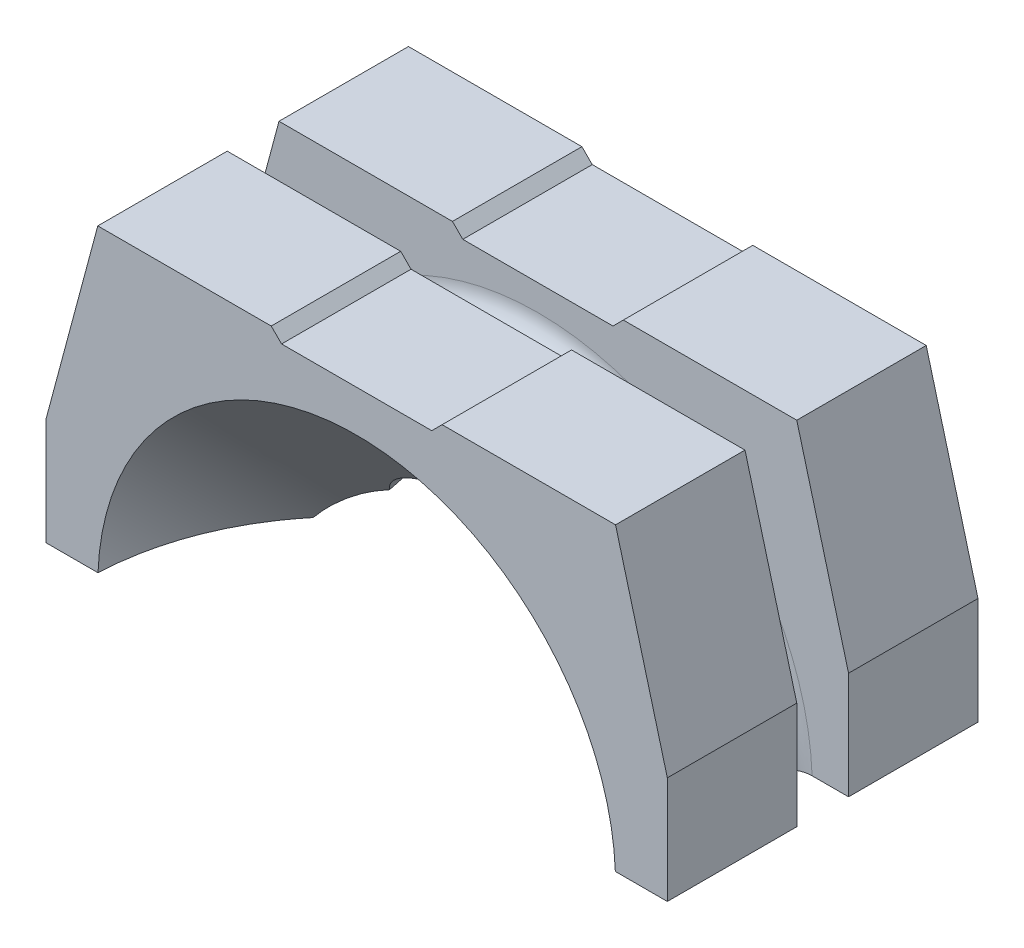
ISO-10303-21;
HEADER;
FILE_DESCRIPTION(('STEP AP214'),'2;1');
FILE_NAME('part.step','',(''),(''),'','','');
FILE_SCHEMA(('AUTOMOTIVE_DESIGN { 1 0 10303 214 1 1 1 1 }'));
ENDSEC;
DATA;
#1=APPLICATION_CONTEXT('core data for automotive mechanical design processes');
#2=APPLICATION_PROTOCOL_DEFINITION('international standard','automotive_design',2000,#1);
#3=PRODUCT_CONTEXT('',#1,'mechanical');
#4=PRODUCT('Part','Part','',(#3));
#5=PRODUCT_RELATED_PRODUCT_CATEGORY('part','',(#4));
#6=PRODUCT_DEFINITION_FORMATION('','',#4);
#7=PRODUCT_DEFINITION_CONTEXT('part definition',#1,'design');
#8=PRODUCT_DEFINITION('design','',#6,#7);
#9=PRODUCT_DEFINITION_SHAPE('','',#8);
#10=(LENGTH_UNIT() NAMED_UNIT(*) SI_UNIT(.MILLI.,.METRE.));
#11=(NAMED_UNIT(*) PLANE_ANGLE_UNIT() SI_UNIT($,.RADIAN.));
#12=(NAMED_UNIT(*) SI_UNIT($,.STERADIAN.) SOLID_ANGLE_UNIT());
#13=UNCERTAINTY_MEASURE_WITH_UNIT(LENGTH_MEASURE(1.E-05),#10,'distance_accuracy_value','');
#14=(GEOMETRIC_REPRESENTATION_CONTEXT(3) GLOBAL_UNCERTAINTY_ASSIGNED_CONTEXT((#13)) GLOBAL_UNIT_ASSIGNED_CONTEXT((#10,
#11,#12)) REPRESENTATION_CONTEXT('',''));
#15=CARTESIAN_POINT('',(0.,0.,0.));
#16=DIRECTION('',(0.,0.,1.));
#17=DIRECTION('',(1.,0.,0.));
#18=AXIS2_PLACEMENT_3D('',#15,#16,#17);
#19=CARTESIAN_POINT('',(-6.,6.00000000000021,3.00000000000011));
#20=DIRECTION('',(0.,-1.00000000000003,0.));
#21=DIRECTION('',(0.,0.,-1.00000000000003));
#22=AXIS2_PLACEMENT_3D('',#19,#20,#21);
#23=PLANE('',#22);
#24=DIRECTION('',(-1.,0.,0.));
#25=VECTOR('',#24,1.);
#26=CARTESIAN_POINT('',(-6.,6.00000000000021,-3.00000000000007));
#27=LINE('',#26,#25);
#28=CARTESIAN_POINT('',(5.,6.00000000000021,-3.00000000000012));
#29=VERTEX_POINT('',#28);
#30=CARTESIAN_POINT('',(1.65,6.00000000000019,-3.0000000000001));
#31=VERTEX_POINT('',#30);
#32=EDGE_CURVE('E206',#29,#31,#27,.T.);
#33=ORIENTED_EDGE('',*,*,#32,.T.);
#34=DIRECTION('',(0.,0.,1.00000000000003));
#35=VECTOR('',#34,1.);
#36=CARTESIAN_POINT('',(1.65,6.00000000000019,-3.0000000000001));
#37=LINE('',#36,#35);
#38=CARTESIAN_POINT('',(1.65,6.00000000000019,-0.500000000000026));
#39=VERTEX_POINT('',#38);
#40=EDGE_CURVE('E188',#31,#39,#37,.T.);
#41=ORIENTED_EDGE('',*,*,#40,.T.);
#42=DIRECTION('',(-1.,0.,0.));
#43=VECTOR('',#42,1.);
#44=CARTESIAN_POINT('',(-6.,6.00000000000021,-0.5));
#45=LINE('',#44,#43);
#46=CARTESIAN_POINT('',(5.,6.00000000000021,-0.500000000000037));
#47=VERTEX_POINT('',#46);
#48=EDGE_CURVE('E370',#47,#39,#45,.T.);
#49=ORIENTED_EDGE('',*,*,#48,.F.);
#50=DIRECTION('',(0.,0.,-1.00000000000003));
#51=VECTOR('',#50,1.);
#52=CARTESIAN_POINT('',(5.,6.00000000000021,3.0000000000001));
#53=LINE('',#52,#51);
#54=EDGE_CURVE('E212',#47,#29,#53,.T.);
#55=ORIENTED_EDGE('',*,*,#54,.T.);
#56=EDGE_LOOP('',(#33,#41,#49,#55));
#57=FACE_BOUND('',#56,.T.);
#58=ADVANCED_FACE('F14',(#57),#23,.F.);
#59=DIRECTION('',(1.,0.,0.));
#60=VECTOR('',#59,1.);
#61=CARTESIAN_POINT('',(-6.,6.00000000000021,0.500000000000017));
#62=LINE('',#61,#60);
#63=CARTESIAN_POINT('',(1.64999999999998,6.00000000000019,0.5));
#64=VERTEX_POINT('',#63);
#65=CARTESIAN_POINT('',(5.,6.00000000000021,0.5));
#66=VERTEX_POINT('',#65);
#67=EDGE_CURVE('E361',#64,#66,#62,.T.);
#68=ORIENTED_EDGE('',*,*,#67,.F.);
#69=DIRECTION('',(0.,0.,1.00000000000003));
#70=VECTOR('',#69,1.);
#71=CARTESIAN_POINT('',(1.64999999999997,6.00000000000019,3.0000000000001));
#72=LINE('',#71,#70);
#73=CARTESIAN_POINT('',(1.64999999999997,6.00000000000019,3.0000000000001));
#74=VERTEX_POINT('',#73);
#75=EDGE_CURVE('E9',#64,#74,#72,.T.);
#76=ORIENTED_EDGE('',*,*,#75,.T.);
#77=DIRECTION('',(-1.,0.,0.));
#78=VECTOR('',#77,1.);
#79=CARTESIAN_POINT('',(-6.,6.00000000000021,3.00000000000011));
#80=LINE('',#79,#78);
#81=CARTESIAN_POINT('',(5.,6.00000000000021,3.0000000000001));
#82=VERTEX_POINT('',#81);
#83=EDGE_CURVE('E378',#82,#74,#80,.T.);
#84=ORIENTED_EDGE('',*,*,#83,.F.);
#85=DIRECTION('',(0.,0.,-1.00000000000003));
#86=VECTOR('',#85,1.);
#87=CARTESIAN_POINT('',(5.,6.00000000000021,3.0000000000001));
#88=LINE('',#87,#86);
#89=EDGE_CURVE('E247',#82,#66,#88,.T.);
#90=ORIENTED_EDGE('',*,*,#89,.T.);
#91=EDGE_LOOP('',(#68,#76,#84,#90));
#92=FACE_BOUND('',#91,.T.);
#93=ADVANCED_FACE('F470',(#92),#23,.F.);
#94=CARTESIAN_POINT('',(6.,6.00000000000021,-3.00000000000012));
#95=DIRECTION('',(0.,0.,-1.00000000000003));
#96=DIRECTION('',(-1.,0.,0.));
#97=AXIS2_PLACEMENT_3D('',#94,#95,#96);
#98=PLANE('',#97);
#99=DIRECTION('',(0.707106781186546,0.707106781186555,0.));
#100=VECTOR('',#99,1.);
#101=CARTESIAN_POINT('',(1.65,6.00000000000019,-3.0000000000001));
#102=LINE('',#101,#100);
#103=CARTESIAN_POINT('',(1.44999999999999,5.80000000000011,-3.0000000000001));
#104=VERTEX_POINT('',#103);
#105=EDGE_CURVE('E192',#104,#31,#102,.T.);
#106=ORIENTED_EDGE('',*,*,#105,.T.);
#107=ORIENTED_EDGE('',*,*,#32,.F.);
#108=DIRECTION('',(-0.258819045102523,0.965925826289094,0.));
#109=VECTOR('',#108,1.);
#110=CARTESIAN_POINT('',(5.06698729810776,5.75000000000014,-3.00000000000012));
#111=LINE('',#110,#109);
#112=CARTESIAN_POINT('',(6.,2.26794919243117,-3.00000000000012));
#113=VERTEX_POINT('',#112);
#114=EDGE_CURVE('E226',#29,#113,#111,.F.);
#115=ORIENTED_EDGE('',*,*,#114,.T.);
#116=DIRECTION('',(0.,1.00000000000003,0.));
#117=VECTOR('',#116,1.);
#118=CARTESIAN_POINT('',(6.,-6.00000000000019,-3.00000000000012));
#119=LINE('',#118,#117);
#120=CARTESIAN_POINT('',(6.,0.199999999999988,-3.00000000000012));
#121=VERTEX_POINT('',#120);
#122=EDGE_CURVE('E219',#121,#113,#119,.T.);
#123=ORIENTED_EDGE('',*,*,#122,.F.);
#124=DIRECTION('',(-1.,0.,0.));
#125=VECTOR('',#124,1.);
#126=CARTESIAN_POINT('',(-6.,0.200000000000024,-3.00000000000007));
#127=LINE('',#126,#125);
#128=CARTESIAN_POINT('',(4.99599839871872,0.199999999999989,-3.00000000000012));
#129=VERTEX_POINT('',#128);
#130=EDGE_CURVE('E308',#121,#129,#127,.T.);
#131=ORIENTED_EDGE('',*,*,#130,.T.);
#132=CARTESIAN_POINT('',(0.,0.,-3.0000000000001));
#133=DIRECTION('',(0.,0.,1.00000000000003));
#134=DIRECTION('',(1.,0.,0.));
#135=AXIS2_PLACEMENT_3D('',#132,#133,#134);
#136=CIRCLE('',#135,5.);
#137=CARTESIAN_POINT('',(-4.99599839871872,0.200000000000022,-3.00000000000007));
#138=VERTEX_POINT('',#137);
#139=EDGE_CURVE('E432',#129,#138,#136,.T.);
#140=ORIENTED_EDGE('',*,*,#139,.T.);
#141=CARTESIAN_POINT('',(-6.,0.200000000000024,-3.00000000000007));
#142=VERTEX_POINT('',#141);
#143=EDGE_CURVE('E306',#138,#142,#127,.T.);
#144=ORIENTED_EDGE('',*,*,#143,.T.);
#145=DIRECTION('',(0.,-1.00000000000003,0.));
#146=VECTOR('',#145,1.);
#147=CARTESIAN_POINT('',(-6.,-6.00000000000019,-3.00000000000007));
#148=LINE('',#147,#146);
#149=CARTESIAN_POINT('',(-6.,2.26794919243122,-3.00000000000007));
#150=VERTEX_POINT('',#149);
#151=EDGE_CURVE('E213',#150,#142,#148,.T.);
#152=ORIENTED_EDGE('',*,*,#151,.F.);
#153=DIRECTION('',(-0.25881904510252,-0.965925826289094,0.));
#154=VECTOR('',#153,1.);
#155=CARTESIAN_POINT('',(-4.26313972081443,8.75000000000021,-3.00000000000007));
#156=LINE('',#155,#154);
#157=CARTESIAN_POINT('',(-5.,6.00000000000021,-3.00000000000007));
#158=VERTEX_POINT('',#157);
#159=EDGE_CURVE('E229',#150,#158,#156,.F.);
#160=ORIENTED_EDGE('',*,*,#159,.T.);
#161=CARTESIAN_POINT('',(-1.65,6.00000000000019,-3.0000000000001));
#162=VERTEX_POINT('',#161);
#163=EDGE_CURVE('E214',#162,#158,#27,.T.);
#164=ORIENTED_EDGE('',*,*,#163,.F.);
#165=DIRECTION('',(0.707106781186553,-0.707106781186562,0.));
#166=VECTOR('',#165,1.);
#167=CARTESIAN_POINT('',(-1.65,6.00000000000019,-3.0000000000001));
#168=LINE('',#167,#166);
#169=CARTESIAN_POINT('',(-1.45000000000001,5.80000000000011,-3.0000000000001));
#170=VERTEX_POINT('',#169);
#171=EDGE_CURVE('E29',#162,#170,#168,.T.);
#172=ORIENTED_EDGE('',*,*,#171,.T.);
#173=DIRECTION('',(1.,0.,0.));
#174=VECTOR('',#173,1.);
#175=CARTESIAN_POINT('',(1.44999999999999,5.80000000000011,-3.0000000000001));
#176=LINE('',#175,#174);
#177=EDGE_CURVE('E201',#170,#104,#176,.T.);
#178=ORIENTED_EDGE('',*,*,#177,.T.);
#179=EDGE_LOOP('',(#106,#107,#115,#123,#131,#140,#144,#152,#160,#164,#172,#178));
#180=FACE_BOUND('',#179,.T.);
#181=ADVANCED_FACE('F205',(#180),#98,.T.);
#182=CARTESIAN_POINT('',(-6.,0.200000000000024,3.00000000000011));
#183=DIRECTION('',(0.,-1.00000000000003,0.));
#184=DIRECTION('',(0.,0.,-1.00000000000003));
#185=AXIS2_PLACEMENT_3D('',#182,#183,#184);
#186=PLANE('',#185);
#187=ORIENTED_EDGE('',*,*,#143,.F.);
#188=CARTESIAN_POINT('',(-4.99599839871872,0.200000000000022,-3.00000000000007));
#189=CARTESIAN_POINT('',(-4.99047020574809,0.200000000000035,-2.86154964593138));
#190=CARTESIAN_POINT('',(-4.97915911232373,0.200000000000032,-2.72333285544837));
#191=CARTESIAN_POINT('',(-4.94511223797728,0.200000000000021,-2.44831940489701));
#192=CARTESIAN_POINT('',(-4.92237695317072,0.200000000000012,-2.31152268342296));
#193=CARTESIAN_POINT('',(-4.86562152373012,0.200000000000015,-2.04028645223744));
#194=CARTESIAN_POINT('',(-4.83160106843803,0.200000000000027,-1.90584700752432));
#195=CARTESIAN_POINT('',(-4.75251537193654,0.200000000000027,-1.64025880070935));
#196=CARTESIAN_POINT('',(-4.70745025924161,0.200000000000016,-1.50911000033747));
#197=CARTESIAN_POINT('',(-4.60659390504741,0.200000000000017,-1.25102993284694));
#198=CARTESIAN_POINT('',(-4.55080452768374,0.200000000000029,-1.12409793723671));
#199=CARTESIAN_POINT('',(-4.42885820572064,0.200000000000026,-0.875259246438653));
#200=CARTESIAN_POINT('',(-4.36269754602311,0.200000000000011,-0.753354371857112));
#201=CARTESIAN_POINT('',(-4.22050577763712,0.200000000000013,-0.515503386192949));
#202=CARTESIAN_POINT('',(-4.1444782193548,0.200000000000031,-0.399555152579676));
#203=CARTESIAN_POINT('',(-3.98303015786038,0.200000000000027,-0.174330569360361));
#204=CARTESIAN_POINT('',(-3.89760629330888,0.200000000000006,-0.0650566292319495));
#205=CARTESIAN_POINT('',(-3.71801043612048,0.200000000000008,0.145981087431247));
#206=CARTESIAN_POINT('',(-3.62384159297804,0.200000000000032,0.247747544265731));
#207=CARTESIAN_POINT('',(-3.42734472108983,0.200000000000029,0.443146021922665));
#208=CARTESIAN_POINT('',(-3.32501377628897,0.200000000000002,0.536775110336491));
#209=CARTESIAN_POINT('',(-3.11296731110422,0.200000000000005,0.715178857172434));
#210=CARTESIAN_POINT('',(-3.00325445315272,0.200000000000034,0.799956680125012));
#211=CARTESIAN_POINT('',(-2.7771285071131,0.20000000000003,0.960139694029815));
#212=CARTESIAN_POINT('',(-2.66071302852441,0.199999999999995,1.03554151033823));
#213=CARTESIAN_POINT('',(-2.42206416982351,0.199999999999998,1.17639067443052));
#214=CARTESIAN_POINT('',(-2.29983289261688,0.200000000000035,1.24184158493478));
#215=CARTESIAN_POINT('',(-2.05031595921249,0.200000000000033,1.36239102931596));
#216=CARTESIAN_POINT('',(-1.92302850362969,0.199999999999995,1.41748583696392));
#217=CARTESIAN_POINT('',(-1.66435521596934,0.199999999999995,1.51689566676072));
#218=CARTESIAN_POINT('',(-1.53297088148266,0.200000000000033,1.56121457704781));
#219=CARTESIAN_POINT('',(-1.26696205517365,0.200000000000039,1.63880498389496));
#220=CARTESIAN_POINT('',(-1.13233640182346,0.200000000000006,1.67207245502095));
#221=CARTESIAN_POINT('',(-0.725105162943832,0.199999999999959,1.75487642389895));
#222=CARTESIAN_POINT('',(-0.448871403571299,0.199999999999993,1.78751943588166));
#223=CARTESIAN_POINT('',(0.105186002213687,0.199999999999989,1.80657283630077));
#224=CARTESIAN_POINT('',(0.383009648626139,0.199999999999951,1.79298322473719));
#225=CARTESIAN_POINT('',(0.794967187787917,0.20000000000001,1.73835022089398));
#226=CARTESIAN_POINT('',(0.931560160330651,0.200000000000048,1.71440964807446));
#227=CARTESIAN_POINT('',(1.20227075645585,0.200000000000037,1.65527640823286));
#228=CARTESIAN_POINT('',(1.33638926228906,0.199999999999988,1.62008783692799));
#229=CARTESIAN_POINT('',(1.60128056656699,0.199999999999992,1.5386827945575));
#230=CARTESIAN_POINT('',(1.73205213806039,0.200000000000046,1.49246234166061));
#231=CARTESIAN_POINT('',(1.98926093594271,0.200000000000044,1.38933861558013));
#232=CARTESIAN_POINT('',(2.11569970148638,0.199999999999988,1.33243918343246));
#233=CARTESIAN_POINT('',(2.36346061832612,0.19999999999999,1.20831709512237));
#234=CARTESIAN_POINT('',(2.48478091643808,0.200000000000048,1.14109074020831));
#235=CARTESIAN_POINT('',(2.72137667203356,0.200000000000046,0.996820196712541));
#236=CARTESIAN_POINT('',(2.83665428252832,0.199999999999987,0.91977953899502));
#237=CARTESIAN_POINT('',(3.0604555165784,0.199999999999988,0.756364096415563));
#238=CARTESIAN_POINT('',(3.16897670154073,0.200000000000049,0.669985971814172));
#239=CARTESIAN_POINT('',(3.37843255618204,0.200000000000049,0.488547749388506));
#240=CARTESIAN_POINT('',(3.47936993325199,0.199999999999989,0.393490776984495));
#241=CARTESIAN_POINT('',(3.67303903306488,0.19999999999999,0.195289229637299));
#242=CARTESIAN_POINT('',(3.76576780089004,0.200000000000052,0.0921417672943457));
#243=CARTESIAN_POINT('',(3.94230658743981,0.200000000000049,-0.121459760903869));
#244=CARTESIAN_POINT('',(4.02611978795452,0.199999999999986,-0.231911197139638));
#245=CARTESIAN_POINT('',(4.18431499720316,0.199999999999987,-0.459432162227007));
#246=CARTESIAN_POINT('',(4.25869364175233,0.200000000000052,-0.576504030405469));
#247=CARTESIAN_POINT('',(4.39744611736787,0.200000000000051,-0.816376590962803));
#248=CARTESIAN_POINT('',(4.46182346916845,0.199999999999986,-0.939175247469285));
#249=CARTESIAN_POINT('',(4.58016716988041,0.199999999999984,-1.18971186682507));
#250=CARTESIAN_POINT('',(4.63413250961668,0.200000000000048,-1.31745030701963));
#251=CARTESIAN_POINT('',(4.73127567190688,0.200000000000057,-1.57696420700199));
#252=CARTESIAN_POINT('',(4.77445177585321,0.200000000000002,-1.70874030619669));
#253=CARTESIAN_POINT('',(4.86523173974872,0.199999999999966,-2.03048282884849));
#254=CARTESIAN_POINT('',(4.90732672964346,0.200000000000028,-2.22204863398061));
#255=CARTESIAN_POINT('',(4.95342538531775,0.200000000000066,-2.51210001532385));
#256=CARTESIAN_POINT('',(4.9659542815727,0.20000000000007,-2.60931641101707));
#257=CARTESIAN_POINT('',(4.98527992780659,0.200000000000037,-2.80430753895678));
#258=CARTESIAN_POINT('',(4.99207725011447,0.199999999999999,-2.90208221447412));
#259=CARTESIAN_POINT('',(4.99599839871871,0.199999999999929,-2.9999999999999));
#260=B_SPLINE_CURVE_WITH_KNOTS('',3,(#188,#189,#190,#191,#192,#193,#194,#195,#196,#197,#198,
#199,#200,#201,#202,#203,#204,#205,#206,#207,#208,#209,#210,#211,#212,#213,#214,#215,#216,#217,
#218,#219,#220,#221,#222,#223,#224,#225,#226,#227,#228,#229,#230,#231,#232,#233,#234,#235,#236,
#237,#238,#239,#240,#241,#242,#243,#244,#245,#246,#247,#248,#249,#250,#251,#252,#253,#254,#255,
#256,#257,#258,#259),.UNSPECIFIED.,.F.,.F.,(4,2,2,2,2,2,2,2,2,2,2,2,2,2,2,2,2,2,2,2,2,2,2,2,2,2,
2,2,2,2,2,2,2,2,2,4),(0.,0.415558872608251,0.83109970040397,1.24665196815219,1.66219940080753,
2.07767466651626,2.49329910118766,2.90877439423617,3.32439880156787,3.73987409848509,
4.15549850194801,4.57097379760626,4.986598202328,5.4020734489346,5.8176979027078,
6.23317216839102,6.64879760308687,7.47917941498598,8.30956122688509,8.72518666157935,
9.14066092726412,9.55628538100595,9.97176062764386,10.387385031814,10.8028603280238,
11.2184847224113,11.6339600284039,12.0495842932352,12.4650597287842,12.8806829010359,
13.2961594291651,13.7116762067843,14.1272591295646,14.7141185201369,15.0080385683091,
15.3019292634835),.UNSPECIFIED.);
#261=CARTESIAN_POINT('',(-3.84187454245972,0.200000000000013,0.));
#262=VERTEX_POINT('',#261);
#263=EDGE_CURVE('E307',#138,#262,#260,.T.);
#264=ORIENTED_EDGE('',*,*,#263,.T.);
#265=CARTESIAN_POINT('',(-4.99599839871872,0.200000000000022,3.00000000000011));
#266=CARTESIAN_POINT('',(-4.99047020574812,0.200000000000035,2.86154964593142));
#267=CARTESIAN_POINT('',(-4.97915911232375,0.200000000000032,2.72333285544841));
#268=CARTESIAN_POINT('',(-4.94511223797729,0.200000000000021,2.44831940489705));
#269=CARTESIAN_POINT('',(-4.92237695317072,0.200000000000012,2.311522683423));
#270=CARTESIAN_POINT('',(-4.86562152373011,0.200000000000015,2.04028645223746));
#271=CARTESIAN_POINT('',(-4.83160106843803,0.200000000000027,1.90584700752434));
#272=CARTESIAN_POINT('',(-4.75251537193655,0.200000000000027,1.64025880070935));
#273=CARTESIAN_POINT('',(-4.70745025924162,0.200000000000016,1.50911000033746));
#274=CARTESIAN_POINT('',(-4.6065939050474,0.200000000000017,1.25102993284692));
#275=CARTESIAN_POINT('',(-4.55080452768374,0.200000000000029,1.1240979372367));
#276=CARTESIAN_POINT('',(-4.42885820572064,0.200000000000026,0.875259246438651));
#277=CARTESIAN_POINT('',(-4.36269754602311,0.200000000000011,0.753354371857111));
#278=CARTESIAN_POINT('',(-4.22050577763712,0.200000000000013,0.515503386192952));
#279=CARTESIAN_POINT('',(-4.1444782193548,0.200000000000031,0.399555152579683));
#280=CARTESIAN_POINT('',(-3.98303015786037,0.200000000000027,0.174330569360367));
#281=CARTESIAN_POINT('',(-3.89760629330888,0.200000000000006,0.0650566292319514));
#282=CARTESIAN_POINT('',(-3.71801043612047,0.200000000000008,-0.145981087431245));
#283=CARTESIAN_POINT('',(-3.62384159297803,0.200000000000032,-0.247747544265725));
#284=CARTESIAN_POINT('',(-3.42734472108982,0.200000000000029,-0.44314602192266));
#285=CARTESIAN_POINT('',(-3.32501377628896,0.200000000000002,-0.536775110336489));
#286=CARTESIAN_POINT('',(-3.11296731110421,0.200000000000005,-0.715178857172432));
#287=CARTESIAN_POINT('',(-3.00325445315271,0.200000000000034,-0.799956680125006));
#288=CARTESIAN_POINT('',(-2.77712850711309,0.20000000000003,-0.960139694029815));
#289=CARTESIAN_POINT('',(-2.6607130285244,0.199999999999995,-1.03554151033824));
#290=CARTESIAN_POINT('',(-2.4220641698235,0.199999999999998,-1.17639067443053));
#291=CARTESIAN_POINT('',(-2.29983289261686,0.200000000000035,-1.24184158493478));
#292=CARTESIAN_POINT('',(-2.05031595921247,0.200000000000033,-1.36239102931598));
#293=CARTESIAN_POINT('',(-1.92302850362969,0.199999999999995,-1.41748583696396));
#294=CARTESIAN_POINT('',(-1.66435521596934,0.199999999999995,-1.51689566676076));
#295=CARTESIAN_POINT('',(-1.53297088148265,0.200000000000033,-1.56121457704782));
#296=CARTESIAN_POINT('',(-1.26696205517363,0.200000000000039,-1.63880498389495));
#297=CARTESIAN_POINT('',(-1.13233640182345,0.200000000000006,-1.67207245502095));
#298=CARTESIAN_POINT('',(-0.725105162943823,0.199999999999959,-1.75487642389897));
#299=CARTESIAN_POINT('',(-0.448871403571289,0.199999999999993,-1.78751943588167));
#300=CARTESIAN_POINT('',(0.105186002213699,0.199999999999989,-1.80657283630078));
#301=CARTESIAN_POINT('',(0.383009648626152,0.199999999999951,-1.7929832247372));
#302=CARTESIAN_POINT('',(0.794967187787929,0.20000000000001,-1.73835022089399));
#303=CARTESIAN_POINT('',(0.93156016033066,0.200000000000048,-1.71440964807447));
#304=CARTESIAN_POINT('',(1.20227075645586,0.200000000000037,-1.65527640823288));
#305=CARTESIAN_POINT('',(1.33638926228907,0.199999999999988,-1.62008783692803));
#306=CARTESIAN_POINT('',(1.601280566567,0.199999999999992,-1.53868279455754));
#307=CARTESIAN_POINT('',(1.73205213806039,0.200000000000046,-1.49246234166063));
#308=CARTESIAN_POINT('',(1.98926093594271,0.200000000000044,-1.38933861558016));
#309=CARTESIAN_POINT('',(2.11569970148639,0.199999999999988,-1.33243918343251));
#310=CARTESIAN_POINT('',(2.36346061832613,0.19999999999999,-1.20831709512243));
#311=CARTESIAN_POINT('',(2.48478091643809,0.200000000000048,-1.14109074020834));
#312=CARTESIAN_POINT('',(2.72137667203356,0.200000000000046,-0.996820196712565));
#313=CARTESIAN_POINT('',(2.83665428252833,0.199999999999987,-0.919779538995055));
#314=CARTESIAN_POINT('',(3.06045551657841,0.199999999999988,-0.756364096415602));
#315=CARTESIAN_POINT('',(3.16897670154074,0.200000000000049,-0.669985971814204));
#316=CARTESIAN_POINT('',(3.37843255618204,0.200000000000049,-0.488547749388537));
#317=CARTESIAN_POINT('',(3.47936993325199,0.199999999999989,-0.393490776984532));
#318=CARTESIAN_POINT('',(3.67303903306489,0.19999999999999,-0.195289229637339));
#319=CARTESIAN_POINT('',(3.76576780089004,0.200000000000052,-0.0921417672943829));
#320=CARTESIAN_POINT('',(3.94230658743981,0.200000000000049,0.121459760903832));
#321=CARTESIAN_POINT('',(4.02611978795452,0.199999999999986,0.231911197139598));
#322=CARTESIAN_POINT('',(4.18431499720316,0.199999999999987,0.459432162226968));
#323=CARTESIAN_POINT('',(4.25869364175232,0.200000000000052,0.576504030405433));
#324=CARTESIAN_POINT('',(4.39744611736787,0.200000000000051,0.816376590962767));
#325=CARTESIAN_POINT('',(4.46182346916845,0.199999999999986,0.939175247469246));
#326=CARTESIAN_POINT('',(4.58016716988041,0.199999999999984,1.18971186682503));
#327=CARTESIAN_POINT('',(4.63413250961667,0.200000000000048,1.31745030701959));
#328=CARTESIAN_POINT('',(4.73127567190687,0.200000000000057,1.57696420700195));
#329=CARTESIAN_POINT('',(4.77445177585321,0.200000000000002,1.70874030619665));
#330=CARTESIAN_POINT('',(4.86523173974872,0.199999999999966,2.03048282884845));
#331=CARTESIAN_POINT('',(4.90732672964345,0.200000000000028,2.22204863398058));
#332=CARTESIAN_POINT('',(4.95342538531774,0.200000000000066,2.51210001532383));
#333=CARTESIAN_POINT('',(4.96595428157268,0.20000000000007,2.60931641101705));
#334=CARTESIAN_POINT('',(4.98527992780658,0.200000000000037,2.80430753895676));
#335=CARTESIAN_POINT('',(4.99207725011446,0.199999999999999,2.9020822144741));
#336=CARTESIAN_POINT('',(4.99599839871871,0.199999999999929,2.99999999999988));
#337=B_SPLINE_CURVE_WITH_KNOTS('',3,(#265,#266,#267,#268,#269,#270,#271,#272,#273,#274,#275,
#276,#277,#278,#279,#280,#281,#282,#283,#284,#285,#286,#287,#288,#289,#290,#291,#292,#293,#294,
#295,#296,#297,#298,#299,#300,#301,#302,#303,#304,#305,#306,#307,#308,#309,#310,#311,#312,#313,
#314,#315,#316,#317,#318,#319,#320,#321,#322,#323,#324,#325,#326,#327,#328,#329,#330,#331,#332,
#333,#334,#335,#336),.UNSPECIFIED.,.F.,.F.,(4,2,2,2,2,2,2,2,2,2,2,2,2,2,2,2,2,2,2,2,2,2,2,2,2,2,
2,2,2,2,2,2,2,2,2,4),(0.,0.415558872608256,0.831099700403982,1.24665196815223,1.6621994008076,
2.07767466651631,2.4932991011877,2.90877439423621,3.32439880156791,3.73987409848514,
4.15549850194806,4.57097379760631,4.98659820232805,5.40207344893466,5.81769790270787,
6.23317216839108,6.64879760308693,7.47917941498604,8.30956122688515,8.72518666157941,
9.14066092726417,9.556285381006,9.97176062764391,10.387385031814,10.8028603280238,
11.2184847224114,11.6339600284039,12.0495842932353,12.4650597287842,12.880682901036,
13.2961594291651,13.7116762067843,14.1272591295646,14.7141185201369,15.0080385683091,
15.3019292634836),.UNSPECIFIED.);
#338=CARTESIAN_POINT('',(-4.99599839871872,0.200000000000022,3.00000000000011));
#339=VERTEX_POINT('',#338);
#340=EDGE_CURVE('E262',#339,#262,#337,.T.);
#341=ORIENTED_EDGE('',*,*,#340,.F.);
#342=DIRECTION('',(-1.,0.,0.));
#343=VECTOR('',#342,1.);
#344=CARTESIAN_POINT('',(-6.,0.200000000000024,3.00000000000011));
#345=LINE('',#344,#343);
#346=CARTESIAN_POINT('',(-6.,0.200000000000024,3.00000000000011));
#347=VERTEX_POINT('',#346);
#348=EDGE_CURVE('E311',#339,#347,#345,.T.);
#349=ORIENTED_EDGE('',*,*,#348,.T.);
#350=DIRECTION('',(0.,0.,-1.00000000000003));
#351=VECTOR('',#350,1.);
#352=CARTESIAN_POINT('',(-6.,0.200000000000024,3.00000000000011));
#353=LINE('',#352,#351);
#354=CARTESIAN_POINT('',(-6.,0.200000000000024,0.500000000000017));
#355=VERTEX_POINT('',#354);
#356=EDGE_CURVE('E316',#347,#355,#353,.T.);
#357=ORIENTED_EDGE('',*,*,#356,.T.);
#358=DIRECTION('',(-1.,0.,0.));
#359=VECTOR('',#358,1.);
#360=CARTESIAN_POINT('',(0.,0.2,0.5));
#361=LINE('',#360,#359);
#362=CARTESIAN_POINT('',(-5.29622507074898,0.200000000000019,0.500000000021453));
#363=VERTEX_POINT('',#362);
#364=EDGE_CURVE('E349',#363,#355,#361,.T.);
#365=ORIENTED_EDGE('',*,*,#364,.F.);
#366=CARTESIAN_POINT('',(-5.02454152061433,0.200000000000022,-0.419879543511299));
#367=CARTESIAN_POINT('',(-5.00094368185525,0.200000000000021,-0.40463259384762));
#368=CARTESIAN_POINT('',(-4.97861553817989,0.200000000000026,-0.387382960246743));
#369=CARTESIAN_POINT('',(-4.9371532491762,0.200000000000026,-0.349365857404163));
#370=CARTESIAN_POINT('',(-4.91802295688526,0.200000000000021,-0.328594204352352));
#371=CARTESIAN_POINT('',(-4.88352951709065,0.200000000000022,-0.284140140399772));
#372=CARTESIAN_POINT('',(-4.86816470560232,0.200000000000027,-0.260459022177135));
#373=CARTESIAN_POINT('',(-4.84163607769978,0.200000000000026,-0.21085848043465));
#374=CARTESIAN_POINT('',(-4.83047121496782,0.200000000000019,-0.184939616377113));
#375=CARTESIAN_POINT('',(-4.81265935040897,0.200000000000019,-0.131607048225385));
#376=CARTESIAN_POINT('',(-4.80601018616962,0.200000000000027,-0.104194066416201));
#377=CARTESIAN_POINT('',(-4.79741114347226,0.200000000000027,-0.0486396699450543));
#378=CARTESIAN_POINT('',(-4.79546143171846,0.200000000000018,-0.0204982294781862));
#379=CARTESIAN_POINT('',(-4.79631720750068,0.200000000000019,0.0356959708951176));
#380=CARTESIAN_POINT('',(-4.7991199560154,0.200000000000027,0.0637487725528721));
#381=CARTESIAN_POINT('',(-4.80939536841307,0.200000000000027,0.118985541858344));
#382=CARTESIAN_POINT('',(-4.81686801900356,0.200000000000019,0.14616951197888));
#383=CARTESIAN_POINT('',(-4.83627008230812,0.200000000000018,0.198897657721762));
#384=CARTESIAN_POINT('',(-4.84819952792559,0.200000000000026,0.224441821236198));
#385=CARTESIAN_POINT('',(-4.87617524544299,0.200000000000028,0.273166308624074));
#386=CARTESIAN_POINT('',(-4.89222152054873,0.200000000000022,0.296346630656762));
#387=CARTESIAN_POINT('',(-4.92798464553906,0.200000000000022,0.339699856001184));
#388=CARTESIAN_POINT('',(-4.94770356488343,0.200000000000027,0.359871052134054));
#389=CARTESIAN_POINT('',(-4.99024559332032,0.200000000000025,0.396619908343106));
#390=CARTESIAN_POINT('',(-5.01306871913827,0.200000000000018,0.413197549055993));
#391=CARTESIAN_POINT('',(-5.06119098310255,0.200000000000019,0.442302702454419));
#392=CARTESIAN_POINT('',(-5.08649209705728,0.200000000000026,0.454826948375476));
#393=CARTESIAN_POINT('',(-5.13883692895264,0.200000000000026,0.475453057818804));
#394=CARTESIAN_POINT('',(-5.16588065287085,0.200000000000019,0.483554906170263));
#395=CARTESIAN_POINT('',(-5.22096133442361,0.200000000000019,0.495110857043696));
#396=CARTESIAN_POINT('',(-5.24899890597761,0.200000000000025,0.498562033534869));
#397=CARTESIAN_POINT('',(-5.30525558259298,0.200000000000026,0.500709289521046));
#398=CARTESIAN_POINT('',(-5.33347468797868,0.20000000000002,0.499405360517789));
#399=CARTESIAN_POINT('',(-5.38929883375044,0.200000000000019,0.492078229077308));
#400=CARTESIAN_POINT('',(-5.41690375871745,0.200000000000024,0.486054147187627));
#401=CARTESIAN_POINT('',(-5.47070997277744,0.200000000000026,0.469455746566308));
#402=CARTESIAN_POINT('',(-5.49691126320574,0.200000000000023,0.458881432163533));
#403=CARTESIAN_POINT('',(-5.54715839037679,0.200000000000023,0.433485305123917));
#404=CARTESIAN_POINT('',(-5.57120482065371,0.200000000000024,0.41866466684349));
#405=CARTESIAN_POINT('',(-5.61646635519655,0.200000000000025,0.385194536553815));
#406=CARTESIAN_POINT('',(-5.63768146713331,0.200000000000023,0.366545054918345));
#407=CARTESIAN_POINT('',(-5.67666516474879,0.200000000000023,0.325957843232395));
#408=CARTESIAN_POINT('',(-5.69443569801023,0.200000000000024,0.304021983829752));
#409=CARTESIAN_POINT('',(-5.72603913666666,0.200000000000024,0.257476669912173));
#410=CARTESIAN_POINT('',(-5.73987205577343,0.200000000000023,0.232867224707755));
#411=CARTESIAN_POINT('',(-5.76319885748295,0.200000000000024,0.181689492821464));
#412=CARTESIAN_POINT('',(-5.77269538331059,0.200000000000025,0.155122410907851));
#413=CARTESIAN_POINT('',(-5.78709124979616,0.200000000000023,0.100770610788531));
#414=CARTESIAN_POINT('',(-5.79199060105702,0.20000000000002,0.0729858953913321));
#415=CARTESIAN_POINT('',(-5.79705138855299,0.20000000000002,0.0170003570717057));
#416=CARTESIAN_POINT('',(-5.79721486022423,0.200000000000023,-0.0112002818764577));
#417=CARTESIAN_POINT('',(-5.79280441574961,0.200000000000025,-0.0672285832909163));
#418=CARTESIAN_POINT('',(-5.78823051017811,0.200000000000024,-0.0950562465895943));
#419=CARTESIAN_POINT('',(-5.77447636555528,0.200000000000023,-0.149545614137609));
#420=CARTESIAN_POINT('',(-5.76529663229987,0.200000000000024,-0.176207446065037));
#421=CARTESIAN_POINT('',(-5.74259236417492,0.200000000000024,-0.227612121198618));
#422=CARTESIAN_POINT('',(-5.72906781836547,0.200000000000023,-0.2523549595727));
#423=CARTESIAN_POINT('',(-5.69805480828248,0.200000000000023,-0.299225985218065));
#424=CARTESIAN_POINT('',(-5.68056538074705,0.200000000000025,-0.321353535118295));
#425=CARTESIAN_POINT('',(-5.64212159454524,0.200000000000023,-0.362360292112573));
#426=CARTESIAN_POINT('',(-5.62116722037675,0.200000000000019,-0.381239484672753));
#427=CARTESIAN_POINT('',(-5.57637644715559,0.20000000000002,-0.415224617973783));
#428=CARTESIAN_POINT('',(-5.55253849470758,0.200000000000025,-0.430328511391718));
#429=CARTESIAN_POINT('',(-5.50266733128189,0.200000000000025,-0.456322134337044));
#430=CARTESIAN_POINT('',(-5.47663419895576,0.20000000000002,-0.467212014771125));
#431=CARTESIAN_POINT('',(-5.42309651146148,0.20000000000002,-0.484475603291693));
#432=CARTESIAN_POINT('',(-5.39559120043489,0.200000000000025,-0.490846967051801));
#433=CARTESIAN_POINT('',(-5.3398938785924,0.200000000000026,-0.498885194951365));
#434=CARTESIAN_POINT('',(-5.31170169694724,0.200000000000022,-0.50055087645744));
#435=CARTESIAN_POINT('',(-5.25541304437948,0.200000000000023,-0.499128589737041));
#436=CARTESIAN_POINT('',(-5.22731669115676,0.200000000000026,-0.496036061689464));
#437=CARTESIAN_POINT('',(-5.17206627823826,0.200000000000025,-0.485177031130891));
#438=CARTESIAN_POINT('',(-5.14491112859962,0.200000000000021,-0.477416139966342));
#439=CARTESIAN_POINT('',(-5.10215489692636,0.200000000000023,-0.461197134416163));
#440=CARTESIAN_POINT('',(-5.08603007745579,0.200000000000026,-0.454084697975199));
#441=CARTESIAN_POINT('',(-5.05461778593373,0.200000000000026,-0.438203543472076));
#442=CARTESIAN_POINT('',(-5.03933031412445,0.200000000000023,-0.429434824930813));
#443=CARTESIAN_POINT('',(-5.02454152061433,0.200000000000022,-0.419879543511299));
#444=B_SPLINE_CURVE_WITH_KNOTS('',3,(#366,#367,#368,#369,#370,#371,#372,#373,#374,#375,#376,
#377,#378,#379,#380,#381,#382,#383,#384,#385,#386,#387,#388,#389,#390,#391,#392,#393,#394,#395,
#396,#397,#398,#399,#400,#401,#402,#403,#404,#405,#406,#407,#408,#409,#410,#411,#412,#413,#414,
#415,#416,#417,#418,#419,#420,#421,#422,#423,#424,#425,#426,#427,#428,#429,#430,#431,#432,#433,
#434,#435,#436,#437,#438,#439,#440,#441,#442,#443),.UNSPECIFIED.,.T.,.F.,(4,2,2,2,2,2,2,2,2,2,2,
2,2,2,2,2,2,2,2,2,2,2,2,2,2,2,2,2,2,2,2,2,2,2,2,2,2,2,4),(0.,0.0842207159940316,
0.168542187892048,0.252826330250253,0.337089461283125,0.42131221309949,0.505537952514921,
0.589715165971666,0.673892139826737,0.758069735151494,0.842247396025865,0.926472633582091,
1.01069832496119,1.09499172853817,1.17928542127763,1.26363212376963,1.34797897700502,
1.43234154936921,1.51670404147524,1.60104322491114,1.68538217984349,1.76967330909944,
1.85396414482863,1.93820353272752,2.02244272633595,2.10664571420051,2.19084851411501,
2.27504206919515,2.35923583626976,2.44345008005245,2.52766470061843,2.6119248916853,
2.69618206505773,2.78048292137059,2.86480496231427,2.94920785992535,3.0335095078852,
3.08629071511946,3.13907193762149),.UNSPECIFIED.);
#445=CARTESIAN_POINT('',(-5.29622507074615,0.200000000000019,-0.5));
#446=VERTEX_POINT('',#445);
#447=EDGE_CURVE('E343',#446,#363,#444,.T.);
#448=ORIENTED_EDGE('',*,*,#447,.F.);
#449=DIRECTION('',(1.,0.,0.));
#450=VECTOR('',#449,1.);
#451=CARTESIAN_POINT('',(0.,0.200000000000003,-0.500000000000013));
#452=LINE('',#451,#450);
#453=CARTESIAN_POINT('',(-6.,0.200000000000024,-0.5));
#454=VERTEX_POINT('',#453);
#455=EDGE_CURVE('E355',#454,#446,#452,.T.);
#456=ORIENTED_EDGE('',*,*,#455,.F.);
#457=EDGE_CURVE('E315',#454,#142,#353,.T.);
#458=ORIENTED_EDGE('',*,*,#457,.T.);
#459=EDGE_LOOP('',(#187,#264,#341,#349,#357,#365,#448,#456,#458));
#460=FACE_BOUND('',#459,.T.);
#461=ADVANCED_FACE('F279',(#460),#186,.T.);
#462=CARTESIAN_POINT('',(3.84187454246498,0.199999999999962,6.30832192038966E-12));
#463=VERTEX_POINT('',#462);
#464=CARTESIAN_POINT('',(4.99599839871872,0.199999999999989,3.0000000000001));
#465=VERTEX_POINT('',#464);
#466=EDGE_CURVE('E261',#463,#465,#337,.T.);
#467=ORIENTED_EDGE('',*,*,#466,.F.);
#468=EDGE_CURVE('E298',#463,#129,#260,.T.);
#469=ORIENTED_EDGE('',*,*,#468,.T.);
#470=ORIENTED_EDGE('',*,*,#130,.F.);
#471=DIRECTION('',(0.,0.,-1.00000000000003));
#472=VECTOR('',#471,1.);
#473=CARTESIAN_POINT('',(6.,0.199999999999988,3.0000000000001));
#474=LINE('',#473,#472);
#475=CARTESIAN_POINT('',(6.,0.199999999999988,-0.500000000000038));
#476=VERTEX_POINT('',#475);
#477=EDGE_CURVE('E318',#476,#121,#474,.T.);
#478=ORIENTED_EDGE('',*,*,#477,.F.);
#479=CARTESIAN_POINT('',(5.2962250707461,0.199999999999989,-0.500000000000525));
#480=VERTEX_POINT('',#479);
#481=EDGE_CURVE('E350',#480,#476,#452,.T.);
#482=ORIENTED_EDGE('',*,*,#481,.F.);
#483=CARTESIAN_POINT('',(4.84997465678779,0.199999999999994,-0.226208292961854));
#484=CARTESIAN_POINT('',(4.86269465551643,0.199999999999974,-0.251257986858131));
#485=CARTESIAN_POINT('',(4.87754072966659,0.200000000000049,-0.275251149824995));
#486=CARTESIAN_POINT('',(4.91106400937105,0.200000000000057,-0.320423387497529));
#487=CARTESIAN_POINT('',(4.92974584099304,0.19999999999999,-0.341599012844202));
#488=CARTESIAN_POINT('',(4.97039152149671,0.199999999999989,-0.380504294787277));
#489=CARTESIAN_POINT('',(4.99235368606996,0.200000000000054,-0.398235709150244));
#490=CARTESIAN_POINT('',(5.03893573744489,0.200000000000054,-0.429757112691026));
#491=CARTESIAN_POINT('',(5.06355496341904,0.199999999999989,-0.443548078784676));
#492=CARTESIAN_POINT('',(5.11477498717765,0.199999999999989,-0.466813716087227));
#493=CARTESIAN_POINT('',(5.14137710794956,0.200000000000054,-0.476285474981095));
#494=CARTESIAN_POINT('',(5.1957945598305,0.200000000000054,-0.490631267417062));
#495=CARTESIAN_POINT('',(5.22360994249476,0.199999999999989,-0.495505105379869));
#496=CARTESIAN_POINT('',(5.27967749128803,0.199999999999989,-0.500517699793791));
#497=CARTESIAN_POINT('',(5.30792985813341,0.200000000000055,-0.500654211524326));
#498=CARTESIAN_POINT('',(5.36405651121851,0.200000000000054,-0.496182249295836));
#499=CARTESIAN_POINT('',(5.3919307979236,0.199999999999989,-0.491573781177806));
#500=CARTESIAN_POINT('',(5.44651034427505,0.199999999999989,-0.477741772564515));
#501=CARTESIAN_POINT('',(5.47321558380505,0.200000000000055,-0.468518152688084));
#502=CARTESIAN_POINT('',(5.52469753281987,0.200000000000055,-0.445716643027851));
#503=CARTESIAN_POINT('',(5.5494742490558,0.199999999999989,-0.432138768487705));
#504=CARTESIAN_POINT('',(5.59638491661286,0.199999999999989,-0.401019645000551));
#505=CARTESIAN_POINT('',(5.61851992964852,0.200000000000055,-0.38347999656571));
#506=CARTESIAN_POINT('',(5.65952888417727,0.200000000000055,-0.344931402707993));
#507=CARTESIAN_POINT('',(5.67840283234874,0.199999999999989,-0.323922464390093));
#508=CARTESIAN_POINT('',(5.71234154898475,0.199999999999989,-0.279045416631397));
#509=CARTESIAN_POINT('',(5.72740863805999,0.200000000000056,-0.255179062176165));
#510=CARTESIAN_POINT('',(5.7533194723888,0.200000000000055,-0.205254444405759));
#511=CARTESIAN_POINT('',(5.76416323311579,0.199999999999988,-0.1791961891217));
#512=CARTESIAN_POINT('',(5.78131341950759,0.199999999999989,-0.125643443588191));
#513=CARTESIAN_POINT('',(5.78762242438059,0.200000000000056,-0.0981497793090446));
#514=CARTESIAN_POINT('',(5.79553340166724,0.200000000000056,-0.0424934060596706));
#515=CARTESIAN_POINT('',(5.79713538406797,0.199999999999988,-0.0143306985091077));
#516=CARTESIAN_POINT('',(5.79558693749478,0.199999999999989,0.0418544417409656));
#517=CARTESIAN_POINT('',(5.79243807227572,0.200000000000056,0.0698769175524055));
#518=CARTESIAN_POINT('',(5.78148050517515,0.200000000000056,0.124995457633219));
#519=CARTESIAN_POINT('',(5.77367180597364,0.199999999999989,0.152091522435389));
#520=CARTESIAN_POINT('',(5.75361672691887,0.199999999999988,0.204588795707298));
#521=CARTESIAN_POINT('',(5.74137027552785,0.200000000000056,0.229989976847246));
#522=CARTESIAN_POINT('',(5.71278814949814,0.200000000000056,0.278376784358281));
#523=CARTESIAN_POINT('',(5.69645246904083,0.199999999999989,0.301362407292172));
#524=CARTESIAN_POINT('',(5.66014974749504,0.199999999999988,0.344274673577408));
#525=CARTESIAN_POINT('',(5.64018141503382,0.200000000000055,0.364200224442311));
#526=CARTESIAN_POINT('',(5.59718466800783,0.200000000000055,0.400418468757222));
#527=CARTESIAN_POINT('',(5.57415624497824,0.199999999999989,0.416711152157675));
#528=CARTESIAN_POINT('',(5.52567875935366,0.199999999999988,0.445211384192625));
#529=CARTESIAN_POINT('',(5.50022829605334,0.200000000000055,0.45741655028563));
#530=CARTESIAN_POINT('',(5.44764036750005,0.200000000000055,0.477383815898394));
#531=CARTESIAN_POINT('',(5.42050289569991,0.199999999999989,0.485145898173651));
#532=CARTESIAN_POINT('',(5.36529377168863,0.199999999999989,0.496011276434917));
#533=CARTESIAN_POINT('',(5.33722156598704,0.200000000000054,0.499111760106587));
#534=CARTESIAN_POINT('',(5.28095496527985,0.200000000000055,0.500557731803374));
#535=CARTESIAN_POINT('',(5.25276057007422,0.19999999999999,0.498903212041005));
#536=CARTESIAN_POINT('',(5.19703878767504,0.199999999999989,0.490884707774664));
#537=CARTESIAN_POINT('',(5.16951165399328,0.200000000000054,0.48451896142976));
#538=CARTESIAN_POINT('',(5.11591679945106,0.200000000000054,0.467256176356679));
#539=CARTESIAN_POINT('',(5.08984908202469,0.19999999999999,0.456359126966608));
#540=CARTESIAN_POINT('',(5.03991521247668,0.199999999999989,0.430342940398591));
#541=CARTESIAN_POINT('',(5.01604893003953,0.200000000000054,0.415224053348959));
#542=CARTESIAN_POINT('',(4.97119502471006,0.200000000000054,0.381192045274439));
#543=CARTESIAN_POINT('',(4.95020740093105,0.199999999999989,0.36227892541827));
#544=CARTESIAN_POINT('',(4.91171862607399,0.199999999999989,0.321205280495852));
#545=CARTESIAN_POINT('',(4.89421569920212,0.200000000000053,0.299046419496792));
#546=CARTESIAN_POINT('',(4.86318266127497,0.200000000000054,0.252103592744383));
#547=CARTESIAN_POINT('',(4.84965237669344,0.19999999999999,0.227319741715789));
#548=CARTESIAN_POINT('',(4.82696027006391,0.19999999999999,0.175853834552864));
#549=CARTESIAN_POINT('',(4.81779452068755,0.200000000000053,0.149173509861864));
#550=CARTESIAN_POINT('',(4.80407374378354,0.200000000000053,0.0946447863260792));
#551=CARTESIAN_POINT('',(4.79951984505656,0.199999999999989,0.0667961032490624));
#552=CARTESIAN_POINT('',(4.79515607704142,0.199999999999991,0.0107374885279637));
#553=CARTESIAN_POINT('',(4.79534531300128,0.200000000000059,-0.0174723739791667));
#554=CARTESIAN_POINT('',(4.80046202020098,0.200000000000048,-0.0734354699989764));
#555=CARTESIAN_POINT('',(4.80538377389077,0.19999999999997,-0.101189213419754));
#556=CARTESIAN_POINT('',(4.81708546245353,0.200000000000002,-0.145229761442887));
#557=CARTESIAN_POINT('',(4.82246868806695,0.200000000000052,-0.161900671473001));
#558=CARTESIAN_POINT('',(4.83495111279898,0.200000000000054,-0.194587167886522));
#559=CARTESIAN_POINT('',(4.8420503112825,0.200000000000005,-0.210602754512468));
#560=CARTESIAN_POINT('',(4.84997465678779,0.199999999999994,-0.226208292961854));
#561=B_SPLINE_CURVE_WITH_KNOTS('',3,(#483,#484,#485,#486,#487,#488,#489,#490,#491,#492,#493,
#494,#495,#496,#497,#498,#499,#500,#501,#502,#503,#504,#505,#506,#507,#508,#509,#510,#511,#512,
#513,#514,#515,#516,#517,#518,#519,#520,#521,#522,#523,#524,#525,#526,#527,#528,#529,#530,#531,
#532,#533,#534,#535,#536,#537,#538,#539,#540,#541,#542,#543,#544,#545,#546,#547,#548,#549,#550,
#551,#552,#553,#554,#555,#556,#557,#558,#559,#560),.UNSPECIFIED.,.T.,.F.,(4,2,2,2,2,2,2,2,2,2,2,
2,2,2,2,2,2,2,2,2,2,2,2,2,2,2,2,2,2,2,2,2,2,2,2,2,2,2,4),(0.,0.0842187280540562,
0.168539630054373,0.252817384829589,0.337074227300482,0.421387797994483,0.505704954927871,
0.590062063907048,0.674419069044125,0.758777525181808,0.843135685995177,0.927459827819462,
1.01178379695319,1.09605623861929,1.18032837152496,1.2645525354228,1.34877652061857,
1.43297278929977,1.51716900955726,1.60136658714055,1.68556428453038,1.76979197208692,
1.85401989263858,1.93829682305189,2.0225740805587,2.10690216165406,2.19123038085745,
2.27559015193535,2.35995012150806,2.44430509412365,2.52866004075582,2.61297188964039,
2.69728005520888,2.78151221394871,2.86576498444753,2.950001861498,3.0341370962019,
3.0866039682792,3.13907082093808),.UNSPECIFIED.);
#562=CARTESIAN_POINT('',(5.29622507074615,0.199999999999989,0.5));
#563=VERTEX_POINT('',#562);
#564=EDGE_CURVE('E322',#563,#480,#561,.T.);
#565=ORIENTED_EDGE('',*,*,#564,.F.);
#566=CARTESIAN_POINT('',(6.,0.199999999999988,0.5));
#567=VERTEX_POINT('',#566);
#568=EDGE_CURVE('E329',#567,#563,#361,.T.);
#569=ORIENTED_EDGE('',*,*,#568,.F.);
#570=CARTESIAN_POINT('',(6.,0.199999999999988,3.0000000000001));
#571=VERTEX_POINT('',#570);
#572=EDGE_CURVE('E319',#571,#567,#474,.T.);
#573=ORIENTED_EDGE('',*,*,#572,.F.);
#574=EDGE_CURVE('E312',#571,#465,#345,.T.);
#575=ORIENTED_EDGE('',*,*,#574,.T.);
#576=EDGE_LOOP('',(#467,#469,#470,#478,#482,#565,#569,#573,#575));
#577=FACE_BOUND('',#576,.T.);
#578=ADVANCED_FACE('F287',(#577),#186,.T.);
#579=CARTESIAN_POINT('',(0.,-4.87916560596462,-1.8791656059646));
#580=DIRECTION('',(0.,0.,1.00000000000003));
#581=DIRECTION('',(1.,0.,0.));
#582=AXIS2_PLACEMENT_3D('',#579,#580,#581);
#583=CIRCLE('',#582,5.);
#584=DIRECTION('',(0.,0.707106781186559,0.707106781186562));
#585=VECTOR('',#584,1.);
#586=SURFACE_OF_LINEAR_EXTRUSION('',#583,#585);
#587=CARTESIAN_POINT('',(4.99882918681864,-2.89180221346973,-9.08821629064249E-12));
#588=CARTESIAN_POINT('',(4.99584503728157,-2.75327367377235,-3.27771551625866E-12));
#589=CARTESIAN_POINT('',(4.98707467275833,-2.61487243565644,-8.9211680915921E-13));
#590=CARTESIAN_POINT('',(4.95808509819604,-2.33927999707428,8.56553692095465E-13));
#591=CARTESIAN_POINT('',(4.93786638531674,-2.20208874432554,2.1975672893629E-13));
#592=CARTESIAN_POINT('',(4.88610270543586,-1.92985576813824,-2.49253483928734E-13));
#593=CARTESIAN_POINT('',(4.85455742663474,-1.79481410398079,0.));
#594=CARTESIAN_POINT('',(4.78036350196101,-1.52781802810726,0.));
#595=CARTESIAN_POINT('',(4.73771498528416,-1.39586358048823,0.));
#596=CARTESIAN_POINT('',(4.64161616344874,-1.13597448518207,0.));
#597=CARTESIAN_POINT('',(4.5881677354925,-1.00803914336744,0.));
#598=CARTESIAN_POINT('',(4.47081275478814,-0.757002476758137,0.));
#599=CARTESIAN_POINT('',(4.40690245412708,-0.633902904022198,0.));
#600=CARTESIAN_POINT('',(4.26910361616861,-0.393480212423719,0.));
#601=CARTESIAN_POINT('',(4.19521866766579,-0.276155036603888,0.));
#602=CARTESIAN_POINT('',(4.03793485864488,-0.0480029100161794,0.));
#603=CARTESIAN_POINT('',(3.95453259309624,0.0628216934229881,0.));
#604=CARTESIAN_POINT('',(3.77884346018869,0.277122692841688,0.));
#605=CARTESIAN_POINT('',(3.68655979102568,0.380601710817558,0.));
#606=CARTESIAN_POINT('',(3.49368522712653,0.5795765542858,0.));
#607=CARTESIAN_POINT('',(3.39309136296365,0.675069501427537,0.));
#608=CARTESIAN_POINT('',(3.18435766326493,0.857338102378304,0.));
#609=CARTESIAN_POINT('',(3.07622054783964,0.944116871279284,0.));
#610=CARTESIAN_POINT('',(2.85307505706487,1.10842643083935,0.));
#611=CARTESIAN_POINT('',(2.73806422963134,1.18595389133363,0.));
#612=CARTESIAN_POINT('',(2.50204280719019,1.33116288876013,0.));
#613=CARTESIAN_POINT('',(2.38103438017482,1.39884794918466,0.));
#614=CARTESIAN_POINT('',(2.13377384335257,1.52396028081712,0.));
#615=CARTESIAN_POINT('',(2.00751986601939,1.58138385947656,0.));
#616=CARTESIAN_POINT('',(1.75071621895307,1.6855283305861,0.));
#617=CARTESIAN_POINT('',(1.62016811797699,1.73225308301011,0.));
#618=CARTESIAN_POINT('',(1.35562938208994,1.81471655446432,0.));
#619=CARTESIAN_POINT('',(1.22163751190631,1.85045127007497,0.));
#620=CARTESIAN_POINT('',(0.815995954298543,1.94072145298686,0.));
#621=CARTESIAN_POINT('',(0.540408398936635,1.97843292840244,0.));
#622=CARTESIAN_POINT('',(-0.0132055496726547,2.00766025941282,0.));
#623=CARTESIAN_POINT('',(-0.291231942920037,1.99917611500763,0.));
#624=CARTESIAN_POINT('',(-0.704123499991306,1.95211932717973,0.));
#625=CARTESIAN_POINT('',(-0.841133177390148,1.93069178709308,0.));
#626=CARTESIAN_POINT('',(-1.1128842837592,1.8765410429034,0.));
#627=CARTESIAN_POINT('',(-1.24762651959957,1.84382195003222,0.));
#628=CARTESIAN_POINT('',(-1.51396841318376,1.76729626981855,0.));
#629=CARTESIAN_POINT('',(-1.6455669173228,1.72348567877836,0.));
#630=CARTESIAN_POINT('',(-1.90462653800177,1.6251038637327,0.));
#631=CARTESIAN_POINT('',(-2.03208912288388,1.57053650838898,0.));
#632=CARTESIAN_POINT('',(-2.28208816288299,1.4509863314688,0.));
#633=CARTESIAN_POINT('',(-2.40462283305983,1.38599977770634,0.));
#634=CARTESIAN_POINT('',(-2.64382869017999,1.24609945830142,0.));
#635=CARTESIAN_POINT('',(-2.76050196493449,1.17118926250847,0.));
#636=CARTESIAN_POINT('',(-2.98726712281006,1.01191225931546,0.));
#637=CARTESIAN_POINT('',(-3.09735662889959,0.927542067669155,0.));
#638=CARTESIAN_POINT('',(-3.31010987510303,0.749981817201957,0.));
#639=CARTESIAN_POINT('',(-3.41277626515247,0.656794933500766,0.));
#640=CARTESIAN_POINT('',(-3.61005337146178,0.462184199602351,0.));
#641=CARTESIAN_POINT('',(-3.70466118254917,0.360757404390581,0.));
#642=CARTESIAN_POINT('',(-3.88509370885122,0.150434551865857,0.));
#643=CARTESIAN_POINT('',(-3.97092156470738,0.0415411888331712,0.));
#644=CARTESIAN_POINT('',(-4.13326906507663,-0.183035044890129,0.));
#645=CARTESIAN_POINT('',(-4.20978539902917,-0.29872030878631,0.));
#646=CARTESIAN_POINT('',(-4.35292077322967,-0.536004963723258,0.));
#647=CARTESIAN_POINT('',(-4.41954326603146,-0.657602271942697,0.));
#648=CARTESIAN_POINT('',(-4.5424664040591,-0.905914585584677,0.));
#649=CARTESIAN_POINT('',(-4.59876638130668,-1.03262992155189,0.));
#650=CARTESIAN_POINT('',(-4.70066350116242,-1.29033270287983,0.));
#651=CARTESIAN_POINT('',(-4.74625828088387,-1.42132108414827,0.));
#652=CARTESIAN_POINT('',(-4.81904458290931,-1.66223806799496,0.));
#653=CARTESIAN_POINT('',(-4.84807818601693,-1.7716145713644,0.));
#654=CARTESIAN_POINT('',(-4.89866922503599,-1.99211288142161,0.));
#655=CARTESIAN_POINT('',(-4.92022502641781,-2.10323506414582,0.));
#656=CARTESIAN_POINT('',(-4.95578470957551,-2.32691406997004,0.));
#657=CARTESIAN_POINT('',(-4.9697729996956,-2.43947336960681,0.));
#658=CARTESIAN_POINT('',(-4.99007134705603,-2.66526098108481,0.));
#659=CARTESIAN_POINT('',(-4.99638282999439,-2.77848916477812,0.));
#660=CARTESIAN_POINT('',(-4.99882918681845,-2.89180221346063,0.));
#661=B_SPLINE_CURVE_WITH_KNOTS('',3,(#587,#588,#589,#590,#591,#592,#593,#594,#595,#596,#597,
#598,#599,#600,#601,#602,#603,#604,#605,#606,#607,#608,#609,#610,#611,#612,#613,#614,#615,#616,
#617,#618,#619,#620,#621,#622,#623,#624,#625,#626,#627,#628,#629,#630,#631,#632,#633,#634,#635,
#636,#637,#638,#639,#640,#641,#642,#643,#644,#645,#646,#647,#648,#649,#650,#651,#652,#653,#654,
#655,#656,#657,#658,#659,#660),.UNSPECIFIED.,.F.,.F.,(4,2,2,2,2,2,2,2,2,2,2,2,2,2,2,2,2,2,2,2,2,
2,2,2,2,2,2,2,2,2,2,2,2,2,2,2,4),(0.,0.415558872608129,0.831099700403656,1.2466519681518,
1.66219940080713,2.07767466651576,2.49329910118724,2.9087743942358,3.32439880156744,
3.73987409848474,4.15549850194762,4.57097379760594,4.98659820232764,5.4020734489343,
5.81769790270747,6.23317216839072,6.64879760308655,7.47917941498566,8.30956122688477,
8.72518666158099,9.14066092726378,9.55628538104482,9.97176062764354,10.3873850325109,
10.8028603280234,11.218484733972,11.6339600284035,12.0495844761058,12.4650597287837,
12.8806822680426,13.296159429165,13.711663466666,14.1272591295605,14.4665023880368,
14.8058197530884,15.1458335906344,15.4857842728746),.UNSPECIFIED.);
#662=CARTESIAN_POINT('',(-2.36325219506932,1.40625000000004,0.));
#663=VERTEX_POINT('',#662);
#664=EDGE_CURVE('E271',#663,#262,#661,.T.);
#665=ORIENTED_EDGE('',*,*,#664,.F.);
#666=CARTESIAN_POINT('',(-2.36325219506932,1.40625000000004,0.));
#667=CARTESIAN_POINT('',(-2.32851371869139,1.46464873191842,0.0397729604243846));
#668=CARTESIAN_POINT('',(-2.29115000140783,1.52249501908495,0.0781027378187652));
#669=CARTESIAN_POINT('',(-2.21116186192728,1.63649024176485,0.151762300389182));
#670=CARTESIAN_POINT('',(-2.16853456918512,1.69263823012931,0.187090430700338));
#671=CARTESIAN_POINT('',(-2.07794324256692,1.80270527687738,0.25466670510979));
#672=CARTESIAN_POINT('',(-2.02996717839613,1.85661892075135,0.286907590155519));
#673=CARTESIAN_POINT('',(-1.92890579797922,1.96140737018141,0.348127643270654));
#674=CARTESIAN_POINT('',(-1.87582148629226,2.01228277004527,0.377107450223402));
#675=CARTESIAN_POINT('',(-1.76456739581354,2.11052802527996,0.431865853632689));
#676=CARTESIAN_POINT('',(-1.70637990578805,2.15788452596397,0.457632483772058));
#677=CARTESIAN_POINT('',(-1.58540152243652,2.24826742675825,0.50584108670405));
#678=CARTESIAN_POINT('',(-1.52260883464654,2.29129212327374,0.528281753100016));
#679=CARTESIAN_POINT('',(-1.39298858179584,2.37232146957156,0.569805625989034));
#680=CARTESIAN_POINT('',(-1.32616915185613,2.41033577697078,0.58889531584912));
#681=CARTESIAN_POINT('',(-1.18889567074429,2.48092673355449,0.623811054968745));
#682=CARTESIAN_POINT('',(-1.11844036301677,2.51350148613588,0.63963596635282));
#683=CARTESIAN_POINT('',(-0.91287419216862,2.59806670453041,0.680219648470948));
#684=CARTESIAN_POINT('',(-0.773923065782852,2.64288649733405,0.701069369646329));
#685=CARTESIAN_POINT('',(-0.489549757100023,2.71002265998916,0.731979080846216));
#686=CARTESIAN_POINT('',(-0.344125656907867,2.73233231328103,0.742035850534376));
#687=CARTESIAN_POINT('',(-0.0561991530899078,2.75308153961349,0.751392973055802));
#688=CARTESIAN_POINT('',(0.0862353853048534,2.75230398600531,0.751046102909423));
#689=CARTESIAN_POINT('',(0.368885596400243,2.72883320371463,0.740453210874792));
#690=CARTESIAN_POINT('',(0.509101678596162,2.70614406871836,0.730209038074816));
#691=CARTESIAN_POINT('',(0.782619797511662,2.64001868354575,0.699731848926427));
#692=CARTESIAN_POINT('',(0.915954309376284,2.5966921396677,0.6795516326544));
#693=CARTESIAN_POINT('',(1.17283781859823,2.49122958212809,0.628955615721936));
#694=CARTESIAN_POINT('',(1.29638866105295,2.42909712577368,0.598541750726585));
#695=CARTESIAN_POINT('',(1.53230983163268,2.2877311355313,0.526703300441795));
#696=CARTESIAN_POINT('',(1.64449294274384,2.20826360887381,0.485126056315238));
#697=CARTESIAN_POINT('',(1.85323545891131,2.03625002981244,0.391042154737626));
#698=CARTESIAN_POINT('',(1.94978699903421,1.94369743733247,0.338530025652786));
#699=CARTESIAN_POINT('',(2.10097763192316,1.77687328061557,0.239173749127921));
#700=CARTESIAN_POINT('',(2.15976930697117,1.70477554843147,0.194885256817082));
#701=CARTESIAN_POINT('',(2.2682650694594,1.5575106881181,0.101213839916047));
#702=CARTESIAN_POINT('',(2.31799383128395,1.48235259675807,0.0518453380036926));
#703=CARTESIAN_POINT('',(2.36325219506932,1.40625000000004,0.));
#704=B_SPLINE_CURVE_WITH_KNOTS('',3,(#666,#667,#668,#669,#670,#671,#672,#673,#674,#675,#676,
#677,#678,#679,#680,#681,#682,#683,#684,#685,#686,#687,#688,#689,#690,#691,#692,#693,#694,#695,
#696,#697,#698,#699,#700,#701,#702,#703),.UNSPECIFIED.,.F.,.F.,(4,2,2,2,2,2,2,2,2,2,2,2,2,2,2,2,
2,2,4),(0.,0.236173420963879,0.472476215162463,0.709321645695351,0.946120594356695,
1.18377662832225,1.42152576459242,1.65880971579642,1.89617622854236,2.33621706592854,
2.776389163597,3.20165289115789,3.62683718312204,4.04978604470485,4.47265495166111,
4.90163032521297,5.33082086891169,5.63937381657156,5.9470737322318),.UNSPECIFIED.);
#705=CARTESIAN_POINT('',(2.36325219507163,1.40624999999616,2.64458593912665E-12));
#706=VERTEX_POINT('',#705);
#707=EDGE_CURVE('E426',#663,#706,#704,.T.);
#708=ORIENTED_EDGE('',*,*,#707,.T.);
#709=EDGE_CURVE('E272',#463,#706,#661,.T.);
#710=ORIENTED_EDGE('',*,*,#709,.F.);
#711=ORIENTED_EDGE('',*,*,#466,.T.);
#712=CARTESIAN_POINT('',(0.,0.,3.0000000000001));
#713=DIRECTION('',(0.,0.,1.00000000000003));
#714=DIRECTION('',(1.,0.,0.));
#715=AXIS2_PLACEMENT_3D('',#712,#713,#714);
#716=CIRCLE('',#715,5.);
#717=EDGE_CURVE('E304',#465,#339,#716,.T.);
#718=ORIENTED_EDGE('',*,*,#717,.T.);
#719=ORIENTED_EDGE('',*,*,#340,.T.);
#720=EDGE_LOOP('',(#665,#708,#710,#711,#718,#719));
#721=FACE_BOUND('',#720,.T.);
#722=ADVANCED_FACE('F282',(#721),#586,.F.);
#723=CARTESIAN_POINT('',(6.,-6.00000000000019,3.0000000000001));
#724=DIRECTION('',(-1.,0.,0.));
#725=DIRECTION('',(0.,0.,1.00000000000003));
#726=AXIS2_PLACEMENT_3D('',#723,#724,#725);
#727=PLANE('',#726);
#728=ORIENTED_EDGE('',*,*,#122,.T.);
#729=DIRECTION('',(0.,0.,1.00000000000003));
#730=VECTOR('',#729,1.);
#731=CARTESIAN_POINT('',(6.,2.26794919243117,3.0000000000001));
#732=LINE('',#731,#730);
#733=CARTESIAN_POINT('',(6.,2.26794919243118,-0.500000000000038));
#734=VERTEX_POINT('',#733);
#735=EDGE_CURVE('E257',#113,#734,#732,.T.);
#736=ORIENTED_EDGE('',*,*,#735,.T.);
#737=DIRECTION('',(0.,1.00000000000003,0.));
#738=VECTOR('',#737,1.);
#739=CARTESIAN_POINT('',(6.,-6.00000000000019,-0.500000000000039));
#740=LINE('',#739,#738);
#741=EDGE_CURVE('E372',#476,#734,#740,.T.);
#742=ORIENTED_EDGE('',*,*,#741,.F.);
#743=ORIENTED_EDGE('',*,*,#477,.T.);
#744=EDGE_LOOP('',(#728,#736,#742,#743));
#745=FACE_BOUND('',#744,.T.);
#746=ADVANCED_FACE('F286',(#745),#727,.F.);
#747=CARTESIAN_POINT('',(-6.,-6.00000000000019,3.00000000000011));
#748=DIRECTION('',(1.,0.,0.));
#749=DIRECTION('',(0.,0.,-1.00000000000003));
#750=AXIS2_PLACEMENT_3D('',#747,#748,#749);
#751=PLANE('',#750);
#752=DIRECTION('',(0.,-1.00000000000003,0.));
#753=VECTOR('',#752,1.);
#754=CARTESIAN_POINT('',(-6.,-6.00000000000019,-0.5));
#755=LINE('',#754,#753);
#756=CARTESIAN_POINT('',(-6.,2.2679491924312,-0.5));
#757=VERTEX_POINT('',#756);
#758=EDGE_CURVE('E367',#757,#454,#755,.T.);
#759=ORIENTED_EDGE('',*,*,#758,.F.);
#760=DIRECTION('',(0.,0.,-1.00000000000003));
#761=VECTOR('',#760,1.);
#762=CARTESIAN_POINT('',(-6.,2.2679491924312,3.00000000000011));
#763=LINE('',#762,#761);
#764=EDGE_CURVE('E223',#757,#150,#763,.T.);
#765=ORIENTED_EDGE('',*,*,#764,.T.);
#766=ORIENTED_EDGE('',*,*,#151,.T.);
#767=ORIENTED_EDGE('',*,*,#457,.F.);
#768=EDGE_LOOP('',(#759,#765,#766,#767));
#769=FACE_BOUND('',#768,.T.);
#770=ADVANCED_FACE('F514',(#769),#751,.F.);
#771=CARTESIAN_POINT('',(0.,-5.3000000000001,-0.500000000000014));
#772=DIRECTION('',(0.,0.,1.00000000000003));
#773=DIRECTION('',(0.,-1.00000000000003,0.));
#774=AXIS2_PLACEMENT_3D('',#771,#772,#773);
#775=PLANE('',#774);
#776=DIRECTION('',(0.707106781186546,0.707106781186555,0.));
#777=VECTOR('',#776,1.);
#778=CARTESIAN_POINT('',(-4.825,-0.47499999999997,-0.500000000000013));
#779=LINE('',#778,#777);
#780=CARTESIAN_POINT('',(1.44999999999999,5.80000000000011,-0.500000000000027));
#781=VERTEX_POINT('',#780);
#782=EDGE_CURVE('E195',#781,#39,#779,.T.);
#783=ORIENTED_EDGE('',*,*,#782,.F.);
#784=DIRECTION('',(1.,0.,0.));
#785=VECTOR('',#784,1.);
#786=CARTESIAN_POINT('',(0.,5.80000000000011,-0.500000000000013));
#787=LINE('',#786,#785);
#788=CARTESIAN_POINT('',(-1.45000000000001,5.80000000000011,-0.500000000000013));
#789=VERTEX_POINT('',#788);
#790=EDGE_CURVE('E416',#789,#781,#787,.T.);
#791=ORIENTED_EDGE('',*,*,#790,.F.);
#792=DIRECTION('',(0.707106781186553,-0.707106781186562,0.));
#793=VECTOR('',#792,1.);
#794=CARTESIAN_POINT('',(4.825,-0.474999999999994,-0.500000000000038));
#795=LINE('',#794,#793);
#796=CARTESIAN_POINT('',(-1.65,6.00000000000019,-0.500000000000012));
#797=VERTEX_POINT('',#796);
#798=EDGE_CURVE('E421',#797,#789,#795,.T.);
#799=ORIENTED_EDGE('',*,*,#798,.F.);
#800=CARTESIAN_POINT('',(-5.,6.00000000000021,-0.5));
#801=VERTEX_POINT('',#800);
#802=EDGE_CURVE('E369',#797,#801,#45,.T.);
#803=ORIENTED_EDGE('',*,*,#802,.T.);
#804=DIRECTION('',(0.25881904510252,0.965925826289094,0.));
#805=VECTOR('',#804,1.);
#806=CARTESIAN_POINT('',(-7.4900635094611,-3.29304353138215,-0.499999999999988));
#807=LINE('',#806,#805);
#808=EDGE_CURVE('E238',#801,#757,#807,.F.);
#809=ORIENTED_EDGE('',*,*,#808,.T.);
#810=ORIENTED_EDGE('',*,*,#758,.T.);
#811=ORIENTED_EDGE('',*,*,#455,.T.);
#812=CARTESIAN_POINT('',(0.,0.,-0.500000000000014));
#813=DIRECTION('',(0.,0.,-1.00000000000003));
#814=DIRECTION('',(0.,1.00000000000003,0.));
#815=AXIS2_PLACEMENT_3D('',#812,#813,#814);
#816=CIRCLE('',#815,5.3);
#817=EDGE_CURVE('E354',#446,#480,#816,.T.);
#818=ORIENTED_EDGE('',*,*,#817,.T.);
#819=ORIENTED_EDGE('',*,*,#481,.T.);
#820=ORIENTED_EDGE('',*,*,#741,.T.);
#821=DIRECTION('',(0.258819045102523,-0.965925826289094,0.));
#822=VECTOR('',#821,1.);
#823=CARTESIAN_POINT('',(7.4900635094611,-3.29304353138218,-0.500000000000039));
#824=LINE('',#823,#822);
#825=EDGE_CURVE('E236',#734,#47,#824,.F.);
#826=ORIENTED_EDGE('',*,*,#825,.T.);
#827=ORIENTED_EDGE('',*,*,#48,.T.);
#828=EDGE_LOOP('',(#783,#791,#799,#803,#809,#810,#811,#818,#819,#820,#826,#827));
#829=FACE_BOUND('',#828,.T.);
#830=ADVANCED_FACE('F339',(#829),#775,.T.);
#831=CARTESIAN_POINT('',(0.,-9.0000000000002,0.5));
#832=DIRECTION('',(0.,0.,-1.00000000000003));
#833=DIRECTION('',(0.,1.00000000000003,0.));
#834=AXIS2_PLACEMENT_3D('',#831,#832,#833);
#835=PLANE('',#834);
#836=DIRECTION('',(-0.707106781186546,-0.707106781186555,0.));
#837=VECTOR('',#836,1.);
#838=CARTESIAN_POINT('',(-6.675,-2.325,0.500000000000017));
#839=LINE('',#838,#837);
#840=CARTESIAN_POINT('',(1.44999999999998,5.80000000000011,0.5));
#841=VERTEX_POINT('',#840);
#842=EDGE_CURVE('E418',#64,#841,#839,.T.);
#843=ORIENTED_EDGE('',*,*,#842,.F.);
#844=ORIENTED_EDGE('',*,*,#67,.T.);
#845=DIRECTION('',(-0.258819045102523,0.965925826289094,0.));
#846=VECTOR('',#845,1.);
#847=CARTESIAN_POINT('',(8.4150635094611,-6.74519052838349,0.499999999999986));
#848=LINE('',#847,#846);
#849=CARTESIAN_POINT('',(6.,2.26794919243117,0.5));
#850=VERTEX_POINT('',#849);
#851=EDGE_CURVE('E243',#66,#850,#848,.F.);
#852=ORIENTED_EDGE('',*,*,#851,.T.);
#853=DIRECTION('',(0.,-1.00000000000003,0.));
#854=VECTOR('',#853,1.);
#855=CARTESIAN_POINT('',(6.,-6.00000000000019,0.5));
#856=LINE('',#855,#854);
#857=EDGE_CURVE('E365',#850,#567,#856,.T.);
#858=ORIENTED_EDGE('',*,*,#857,.T.);
#859=ORIENTED_EDGE('',*,*,#568,.T.);
#860=CARTESIAN_POINT('',(0.,0.,0.5));
#861=DIRECTION('',(0.,0.,-1.00000000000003));
#862=DIRECTION('',(0.,1.00000000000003,0.));
#863=AXIS2_PLACEMENT_3D('',#860,#861,#862);
#864=CIRCLE('',#863,5.3);
#865=EDGE_CURVE('E351',#363,#563,#864,.T.);
#866=ORIENTED_EDGE('',*,*,#865,.F.);
#867=ORIENTED_EDGE('',*,*,#364,.T.);
#868=DIRECTION('',(0.,1.00000000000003,0.));
#869=VECTOR('',#868,1.);
#870=CARTESIAN_POINT('',(-6.,-6.00000000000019,0.500000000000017));
#871=LINE('',#870,#869);
#872=CARTESIAN_POINT('',(-6.,2.2679491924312,0.500000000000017));
#873=VERTEX_POINT('',#872);
#874=EDGE_CURVE('E358',#355,#873,#871,.T.);
#875=ORIENTED_EDGE('',*,*,#874,.T.);
#876=DIRECTION('',(-0.25881904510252,-0.965925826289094,0.));
#877=VECTOR('',#876,1.);
#878=CARTESIAN_POINT('',(-8.4150635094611,-6.74519052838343,0.500000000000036));
#879=LINE('',#878,#877);
#880=CARTESIAN_POINT('',(-5.,6.00000000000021,0.500000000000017));
#881=VERTEX_POINT('',#880);
#882=EDGE_CURVE('E245',#873,#881,#879,.F.);
#883=ORIENTED_EDGE('',*,*,#882,.T.);
#884=CARTESIAN_POINT('',(-1.65000000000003,6.00000000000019,0.5));
#885=VERTEX_POINT('',#884);
#886=EDGE_CURVE('E362',#881,#885,#62,.T.);
#887=ORIENTED_EDGE('',*,*,#886,.T.);
#888=DIRECTION('',(-0.707106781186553,0.707106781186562,0.));
#889=VECTOR('',#888,1.);
#890=CARTESIAN_POINT('',(6.675,-2.32500000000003,0.5));
#891=LINE('',#890,#889);
#892=CARTESIAN_POINT('',(-1.45000000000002,5.80000000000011,0.5));
#893=VERTEX_POINT('',#892);
#894=EDGE_CURVE('E37',#893,#885,#891,.T.);
#895=ORIENTED_EDGE('',*,*,#894,.F.);
#896=DIRECTION('',(-1.,0.,0.));
#897=VECTOR('',#896,1.);
#898=CARTESIAN_POINT('',(0.,5.80000000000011,0.5));
#899=LINE('',#898,#897);
#900=EDGE_CURVE('E417',#841,#893,#899,.T.);
#901=ORIENTED_EDGE('',*,*,#900,.F.);
#902=EDGE_LOOP('',(#843,#844,#852,#858,#859,#866,#867,#875,#883,#887,#895,#901));
#903=FACE_BOUND('',#902,.T.);
#904=ADVANCED_FACE('F337',(#903),#835,.T.);
#905=CARTESIAN_POINT('',(0.,0.,0.));
#906=DIRECTION('',(0.,0.,-1.00000000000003));
#907=DIRECTION('',(0.,1.00000000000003,0.));
#908=AXIS2_PLACEMENT_3D('',#905,#906,#907);
#909=TOROIDAL_SURFACE('',#908,5.3,0.5);
#910=ORIENTED_EDGE('',*,*,#817,.F.);
#911=ORIENTED_EDGE('',*,*,#447,.T.);
#912=ORIENTED_EDGE('',*,*,#865,.T.);
#913=ORIENTED_EDGE('',*,*,#564,.T.);
#914=EDGE_LOOP('',(#910,#911,#912,#913));
#915=FACE_BOUND('',#914,.T.);
#916=ADVANCED_FACE('F331',(#915),#909,.F.);
#917=CARTESIAN_POINT('',(6.,6.00000000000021,3.0000000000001));
#918=DIRECTION('',(0.,0.,-1.00000000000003));
#919=DIRECTION('',(-1.,0.,0.));
#920=AXIS2_PLACEMENT_3D('',#917,#918,#919);
#921=PLANE('',#920);
#922=ORIENTED_EDGE('',*,*,#83,.T.);
#923=DIRECTION('',(0.707106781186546,0.707106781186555,0.));
#924=VECTOR('',#923,1.);
#925=CARTESIAN_POINT('',(1.64999999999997,6.00000000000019,3.0000000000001));
#926=LINE('',#925,#924);
#927=CARTESIAN_POINT('',(1.44999999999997,5.80000000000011,3.0000000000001));
#928=VERTEX_POINT('',#927);
#929=EDGE_CURVE('E508',#928,#74,#926,.T.);
#930=ORIENTED_EDGE('',*,*,#929,.F.);
#931=DIRECTION('',(1.,0.,0.));
#932=VECTOR('',#931,1.);
#933=CARTESIAN_POINT('',(1.44999999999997,5.80000000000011,3.0000000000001));
#934=LINE('',#933,#932);
#935=CARTESIAN_POINT('',(-1.45000000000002,5.80000000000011,3.0000000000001));
#936=VERTEX_POINT('',#935);
#937=EDGE_CURVE('E208',#936,#928,#934,.T.);
#938=ORIENTED_EDGE('',*,*,#937,.F.);
#939=DIRECTION('',(0.707106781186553,-0.707106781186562,0.));
#940=VECTOR('',#939,1.);
#941=CARTESIAN_POINT('',(-1.65000000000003,6.00000000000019,3.0000000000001));
#942=LINE('',#941,#940);
#943=CARTESIAN_POINT('',(-1.65000000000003,6.00000000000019,3.0000000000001));
#944=VERTEX_POINT('',#943);
#945=EDGE_CURVE('E506',#944,#936,#942,.T.);
#946=ORIENTED_EDGE('',*,*,#945,.F.);
#947=CARTESIAN_POINT('',(-5.,6.00000000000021,3.00000000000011));
#948=VERTEX_POINT('',#947);
#949=EDGE_CURVE('E377',#944,#948,#80,.T.);
#950=ORIENTED_EDGE('',*,*,#949,.T.);
#951=DIRECTION('',(0.25881904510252,0.965925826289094,0.));
#952=VECTOR('',#951,1.);
#953=CARTESIAN_POINT('',(-6.,2.2679491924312,3.00000000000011));
#954=LINE('',#953,#952);
#955=CARTESIAN_POINT('',(-6.,2.26794919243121,3.00000000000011));
#956=VERTEX_POINT('',#955);
#957=EDGE_CURVE('E255',#948,#956,#954,.F.);
#958=ORIENTED_EDGE('',*,*,#957,.T.);
#959=DIRECTION('',(0.,-1.00000000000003,0.));
#960=VECTOR('',#959,1.);
#961=CARTESIAN_POINT('',(-6.,-6.00000000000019,3.00000000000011));
#962=LINE('',#961,#960);
#963=EDGE_CURVE('E227',#956,#347,#962,.T.);
#964=ORIENTED_EDGE('',*,*,#963,.T.);
#965=ORIENTED_EDGE('',*,*,#348,.F.);
#966=ORIENTED_EDGE('',*,*,#717,.F.);
#967=ORIENTED_EDGE('',*,*,#574,.F.);
#968=DIRECTION('',(0.,1.00000000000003,0.));
#969=VECTOR('',#968,1.);
#970=CARTESIAN_POINT('',(6.,-6.00000000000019,3.0000000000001));
#971=LINE('',#970,#969);
#972=CARTESIAN_POINT('',(6.,2.2679491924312,3.0000000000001));
#973=VERTEX_POINT('',#972);
#974=EDGE_CURVE('E217',#571,#973,#971,.T.);
#975=ORIENTED_EDGE('',*,*,#974,.T.);
#976=DIRECTION('',(0.258819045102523,-0.965925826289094,0.));
#977=VECTOR('',#976,1.);
#978=CARTESIAN_POINT('',(5.,6.00000000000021,3.0000000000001));
#979=LINE('',#978,#977);
#980=EDGE_CURVE('E253',#973,#82,#979,.F.);
#981=ORIENTED_EDGE('',*,*,#980,.T.);
#982=EDGE_LOOP('',(#922,#930,#938,#946,#950,#958,#964,#965,#966,#967,#975,#981));
#983=FACE_BOUND('',#982,.T.);
#984=ADVANCED_FACE('F336',(#983),#921,.F.);
#985=ORIENTED_EDGE('',*,*,#963,.F.);
#986=DIRECTION('',(0.,0.,-1.00000000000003));
#987=VECTOR('',#986,1.);
#988=CARTESIAN_POINT('',(-6.,2.2679491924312,3.00000000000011));
#989=LINE('',#988,#987);
#990=EDGE_CURVE('E240',#956,#873,#989,.T.);
#991=ORIENTED_EDGE('',*,*,#990,.T.);
#992=ORIENTED_EDGE('',*,*,#874,.F.);
#993=ORIENTED_EDGE('',*,*,#356,.F.);
#994=EDGE_LOOP('',(#985,#991,#992,#993));
#995=FACE_BOUND('',#994,.T.);
#996=ADVANCED_FACE('F390',(#995),#751,.F.);
#997=ORIENTED_EDGE('',*,*,#857,.F.);
#998=DIRECTION('',(0.,0.,1.00000000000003));
#999=VECTOR('',#998,1.);
#1000=CARTESIAN_POINT('',(6.,2.26794919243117,3.0000000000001));
#1001=LINE('',#1000,#999);
#1002=EDGE_CURVE('E259',#850,#973,#1001,.T.);
#1003=ORIENTED_EDGE('',*,*,#1002,.T.);
#1004=ORIENTED_EDGE('',*,*,#974,.F.);
#1005=ORIENTED_EDGE('',*,*,#572,.T.);
#1006=EDGE_LOOP('',(#997,#1003,#1004,#1005));
#1007=FACE_BOUND('',#1006,.T.);
#1008=ADVANCED_FACE('F481',(#1007),#727,.F.);
#1009=ORIENTED_EDGE('',*,*,#802,.F.);
#1010=DIRECTION('',(0.,0.,1.00000000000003));
#1011=VECTOR('',#1010,1.);
#1012=CARTESIAN_POINT('',(-1.65,6.00000000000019,-3.0000000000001));
#1013=LINE('',#1012,#1011);
#1014=EDGE_CURVE('E200',#162,#797,#1013,.T.);
#1015=ORIENTED_EDGE('',*,*,#1014,.F.);
#1016=ORIENTED_EDGE('',*,*,#163,.T.);
#1017=DIRECTION('',(0.,0.,1.00000000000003));
#1018=VECTOR('',#1017,1.);
#1019=CARTESIAN_POINT('',(-5.,6.00000000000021,3.00000000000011));
#1020=LINE('',#1019,#1018);
#1021=EDGE_CURVE('E233',#158,#801,#1020,.T.);
#1022=ORIENTED_EDGE('',*,*,#1021,.T.);
#1023=EDGE_LOOP('',(#1009,#1015,#1016,#1022));
#1024=FACE_BOUND('',#1023,.T.);
#1025=ADVANCED_FACE('F472',(#1024),#23,.F.);
#1026=ORIENTED_EDGE('',*,*,#949,.F.);
#1027=DIRECTION('',(0.,0.,-1.00000000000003));
#1028=VECTOR('',#1027,1.);
#1029=CARTESIAN_POINT('',(-1.65000000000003,6.00000000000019,3.0000000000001));
#1030=LINE('',#1029,#1028);
#1031=EDGE_CURVE('E22',#944,#885,#1030,.T.);
#1032=ORIENTED_EDGE('',*,*,#1031,.T.);
#1033=ORIENTED_EDGE('',*,*,#886,.F.);
#1034=DIRECTION('',(0.,0.,1.00000000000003));
#1035=VECTOR('',#1034,1.);
#1036=CARTESIAN_POINT('',(-5.,6.00000000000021,3.00000000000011));
#1037=LINE('',#1036,#1035);
#1038=EDGE_CURVE('E250',#881,#948,#1037,.T.);
#1039=ORIENTED_EDGE('',*,*,#1038,.T.);
#1040=EDGE_LOOP('',(#1026,#1032,#1033,#1039));
#1041=FACE_BOUND('',#1040,.T.);
#1042=ADVANCED_FACE('F451',(#1041),#23,.F.);
#1043=CARTESIAN_POINT('',(-6.,2.2679491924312,3.00000000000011));
#1044=DIRECTION('',(0.965925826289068,-0.25881904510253,0.));
#1045=DIRECTION('',(0.25881904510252,0.965925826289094,0.));
#1046=AXIS2_PLACEMENT_3D('',#1043,#1044,#1045);
#1047=PLANE('',#1046);
#1048=ORIENTED_EDGE('',*,*,#808,.F.);
#1049=ORIENTED_EDGE('',*,*,#1021,.F.);
#1050=ORIENTED_EDGE('',*,*,#159,.F.);
#1051=ORIENTED_EDGE('',*,*,#764,.F.);
#1052=EDGE_LOOP('',(#1048,#1049,#1050,#1051));
#1053=FACE_BOUND('',#1052,.T.);
#1054=ADVANCED_FACE('F459',(#1053),#1047,.F.);
#1055=CARTESIAN_POINT('',(-6.,2.2679491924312,3.00000000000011));
#1056=DIRECTION('',(0.965925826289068,-0.25881904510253,0.));
#1057=DIRECTION('',(0.25881904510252,0.965925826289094,0.));
#1058=AXIS2_PLACEMENT_3D('',#1055,#1056,#1057);
#1059=PLANE('',#1058);
#1060=ORIENTED_EDGE('',*,*,#957,.F.);
#1061=ORIENTED_EDGE('',*,*,#1038,.F.);
#1062=ORIENTED_EDGE('',*,*,#882,.F.);
#1063=ORIENTED_EDGE('',*,*,#990,.F.);
#1064=EDGE_LOOP('',(#1060,#1061,#1062,#1063));
#1065=FACE_BOUND('',#1064,.T.);
#1066=ADVANCED_FACE('F457',(#1065),#1059,.F.);
#1067=CARTESIAN_POINT('',(5.,6.00000000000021,3.0000000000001));
#1068=DIRECTION('',(-0.965925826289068,-0.258819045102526,0.));
#1069=DIRECTION('',(0.258819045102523,-0.965925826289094,0.));
#1070=AXIS2_PLACEMENT_3D('',#1067,#1068,#1069);
#1071=PLANE('',#1070);
#1072=ORIENTED_EDGE('',*,*,#825,.F.);
#1073=ORIENTED_EDGE('',*,*,#735,.F.);
#1074=ORIENTED_EDGE('',*,*,#114,.F.);
#1075=ORIENTED_EDGE('',*,*,#54,.F.);
#1076=EDGE_LOOP('',(#1072,#1073,#1074,#1075));
#1077=FACE_BOUND('',#1076,.T.);
#1078=ADVANCED_FACE('F413',(#1077),#1071,.F.);
#1079=CARTESIAN_POINT('',(5.,6.00000000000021,3.0000000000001));
#1080=DIRECTION('',(-0.965925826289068,-0.258819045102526,0.));
#1081=DIRECTION('',(0.258819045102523,-0.965925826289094,0.));
#1082=AXIS2_PLACEMENT_3D('',#1079,#1080,#1081);
#1083=PLANE('',#1082);
#1084=ORIENTED_EDGE('',*,*,#980,.F.);
#1085=ORIENTED_EDGE('',*,*,#1002,.F.);
#1086=ORIENTED_EDGE('',*,*,#851,.F.);
#1087=ORIENTED_EDGE('',*,*,#89,.F.);
#1088=EDGE_LOOP('',(#1084,#1085,#1086,#1087));
#1089=FACE_BOUND('',#1088,.T.);
#1090=ADVANCED_FACE('F16',(#1089),#1083,.F.);
#1091=CARTESIAN_POINT('',(0.,-4.87916560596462,1.87916560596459));
#1092=DIRECTION('',(0.,0.,1.00000000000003));
#1093=DIRECTION('',(1.,0.,0.));
#1094=AXIS2_PLACEMENT_3D('',#1091,#1092,#1093);
#1095=CIRCLE('',#1094,5.);
#1096=DIRECTION('',(0.,0.707106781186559,-0.707106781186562));
#1097=VECTOR('',#1096,1.);
#1098=SURFACE_OF_LINEAR_EXTRUSION('',#1095,#1097);
#1099=CARTESIAN_POINT('',(-2.36325219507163,1.40624999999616,2.64545330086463E-12));
#1100=CARTESIAN_POINT('',(-2.32851371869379,1.4646487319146,-0.0397729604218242));
#1101=CARTESIAN_POINT('',(-2.29115000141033,1.5224950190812,-0.0781027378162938));
#1102=CARTESIAN_POINT('',(-2.21116186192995,1.63649024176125,-0.15176230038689));
#1103=CARTESIAN_POINT('',(-2.16853456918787,1.69263823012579,-0.187090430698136));
#1104=CARTESIAN_POINT('',(-2.07794324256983,1.80270527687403,-0.254666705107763));
#1105=CARTESIAN_POINT('',(-2.02996717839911,1.85661892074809,-0.286907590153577));
#1106=CARTESIAN_POINT('',(-1.92890579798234,1.96140737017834,-0.348127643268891));
#1107=CARTESIAN_POINT('',(-1.87582148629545,2.0122827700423,-0.377107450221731));
#1108=CARTESIAN_POINT('',(-1.76456739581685,2.1105280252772,-0.431865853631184));
#1109=CARTESIAN_POINT('',(-1.70637990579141,2.15788452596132,-0.457632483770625));
#1110=CARTESIAN_POINT('',(-1.58540152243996,2.24826742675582,-0.50584108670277));
#1111=CARTESIAN_POINT('',(-1.52260883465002,2.29129212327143,-0.528281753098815));
#1112=CARTESIAN_POINT('',(-1.39298858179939,2.37232146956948,-0.569805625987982));
#1113=CARTESIAN_POINT('',(-1.3261691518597,2.41033577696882,-0.588895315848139));
#1114=CARTESIAN_POINT('',(-1.18889567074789,2.48092673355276,-0.623811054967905));
#1115=CARTESIAN_POINT('',(-1.11844036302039,2.51350148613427,-0.639635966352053));
#1116=CARTESIAN_POINT('',(-0.912874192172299,2.59806670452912,-0.680219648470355));
#1117=CARTESIAN_POINT('',(-0.773923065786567,2.64288649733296,-0.701069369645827));
#1118=CARTESIAN_POINT('',(-0.489549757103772,2.71002265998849,-0.731979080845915));
#1119=CARTESIAN_POINT('',(-0.344125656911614,2.73233231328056,-0.742035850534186));
#1120=CARTESIAN_POINT('',(-0.0561991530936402,2.75308153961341,-0.751392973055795));
#1121=CARTESIAN_POINT('',(0.0862353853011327,2.75230398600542,-0.75104610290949));
#1122=CARTESIAN_POINT('',(0.368885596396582,2.72883320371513,-0.740453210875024));
#1123=CARTESIAN_POINT('',(0.509101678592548,2.70614406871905,-0.730209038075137));
#1124=CARTESIAN_POINT('',(0.782619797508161,2.64001868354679,-0.699731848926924));
#1125=CARTESIAN_POINT('',(0.915954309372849,2.59669213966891,-0.679551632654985));
#1126=CARTESIAN_POINT('',(1.17283781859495,2.49122958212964,-0.628955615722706));
#1127=CARTESIAN_POINT('',(1.29638866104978,2.42909712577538,-0.598541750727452));
#1128=CARTESIAN_POINT('',(1.53230983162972,2.28773113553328,-0.526703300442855));
#1129=CARTESIAN_POINT('',(1.64449294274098,2.20826360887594,-0.485126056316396));
#1130=CARTESIAN_POINT('',(1.85323545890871,2.03625002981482,-0.391042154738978));
#1131=CARTESIAN_POINT('',(1.94978699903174,1.94369743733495,-0.338530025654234));
#1132=CARTESIAN_POINT('',(2.10097763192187,1.77687328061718,-0.239173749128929));
#1133=CARTESIAN_POINT('',(2.15976930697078,1.70477554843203,-0.194885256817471));
#1134=CARTESIAN_POINT('',(2.26826506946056,1.55751068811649,-0.101213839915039));
#1135=CARTESIAN_POINT('',(2.31799383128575,1.48235259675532,-0.0518453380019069));
#1136=CARTESIAN_POINT('',(2.36325219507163,1.40624999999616,2.64458593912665E-12));
#1137=B_SPLINE_CURVE_WITH_KNOTS('',3,(#1099,#1100,#1101,#1102,#1103,#1104,#1105,#1106,#1107,
#1108,#1109,#1110,#1111,#1112,#1113,#1114,#1115,#1116,#1117,#1118,#1119,#1120,#1121,#1122,#1123,
#1124,#1125,#1126,#1127,#1128,#1129,#1130,#1131,#1132,#1133,#1134,#1135,#1136),.UNSPECIFIED.,
.F.,.F.,(4,2,2,2,2,2,2,2,2,2,2,2,2,2,2,2,2,2,4),(0.,0.236173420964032,0.472476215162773,
0.70932164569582,0.946120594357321,1.18377662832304,1.42152576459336,1.65880971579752,
1.89617622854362,2.33621706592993,2.77638916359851,3.20165289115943,3.62683718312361,
4.04978604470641,4.47265495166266,4.90163032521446,5.33082086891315,5.63937381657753,
5.94707373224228),.UNSPECIFIED.);
#1138=EDGE_CURVE('E443',#663,#706,#1137,.T.);
#1139=ORIENTED_EDGE('',*,*,#1138,.F.);
#1140=ORIENTED_EDGE('',*,*,#664,.T.);
#1141=ORIENTED_EDGE('',*,*,#263,.F.);
#1142=ORIENTED_EDGE('',*,*,#139,.F.);
#1143=ORIENTED_EDGE('',*,*,#468,.F.);
#1144=ORIENTED_EDGE('',*,*,#709,.T.);
#1145=EDGE_LOOP('',(#1139,#1140,#1141,#1142,#1143,#1144));
#1146=FACE_BOUND('',#1145,.T.);
#1147=ADVANCED_FACE('F289',(#1146),#1098,.T.);
#1148=CARTESIAN_POINT('',(0.,0.,-3.0000000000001));
#1149=DIRECTION('',(0.,0.,1.00000000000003));
#1150=DIRECTION('',(1.,0.,0.));
#1151=AXIS2_PLACEMENT_3D('',#1148,#1149,#1150);
#1152=CYLINDRICAL_SURFACE('',#1151,2.75);
#1153=ORIENTED_EDGE('',*,*,#1138,.T.);
#1154=ORIENTED_EDGE('',*,*,#707,.F.);
#1155=EDGE_LOOP('',(#1153,#1154));
#1156=FACE_BOUND('',#1155,.T.);
#1157=ADVANCED_FACE('F434',(#1156),#1152,.F.);
#1158=CARTESIAN_POINT('',(-1.65,6.00000000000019,-3.0000000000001));
#1159=DIRECTION('',(-0.707106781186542,-0.707106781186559,0.));
#1160=DIRECTION('',(0.707106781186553,-0.707106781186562,0.));
#1161=AXIS2_PLACEMENT_3D('',#1158,#1159,#1160);
#1162=PLANE('',#1161);
#1163=ORIENTED_EDGE('',*,*,#894,.T.);
#1164=ORIENTED_EDGE('',*,*,#1031,.F.);
#1165=ORIENTED_EDGE('',*,*,#945,.T.);
#1166=DIRECTION('',(0.,0.,1.00000000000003));
#1167=VECTOR('',#1166,1.);
#1168=CARTESIAN_POINT('',(-1.45000000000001,5.80000000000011,-3.0000000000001));
#1169=LINE('',#1168,#1167);
#1170=EDGE_CURVE('E499',#893,#936,#1169,.T.);
#1171=ORIENTED_EDGE('',*,*,#1170,.F.);
#1172=EDGE_LOOP('',(#1163,#1164,#1165,#1171));
#1173=FACE_BOUND('',#1172,.T.);
#1174=ADVANCED_FACE('F438',(#1173),#1162,.F.);
#1175=CARTESIAN_POINT('',(1.65,6.00000000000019,-3.0000000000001));
#1176=DIRECTION('',(0.707106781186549,-0.707106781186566,0.));
#1177=DIRECTION('',(0.707106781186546,0.707106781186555,0.));
#1178=AXIS2_PLACEMENT_3D('',#1175,#1176,#1177);
#1179=PLANE('',#1178);
#1180=ORIENTED_EDGE('',*,*,#842,.T.);
#1181=DIRECTION('',(0.,0.,1.00000000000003));
#1182=VECTOR('',#1181,1.);
#1183=CARTESIAN_POINT('',(1.44999999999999,5.80000000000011,-3.0000000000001));
#1184=LINE('',#1183,#1182);
#1185=EDGE_CURVE('E502',#841,#928,#1184,.T.);
#1186=ORIENTED_EDGE('',*,*,#1185,.T.);
#1187=ORIENTED_EDGE('',*,*,#929,.T.);
#1188=ORIENTED_EDGE('',*,*,#75,.F.);
#1189=EDGE_LOOP('',(#1180,#1186,#1187,#1188));
#1190=FACE_BOUND('',#1189,.T.);
#1191=ADVANCED_FACE('F440',(#1190),#1179,.F.);
#1192=CARTESIAN_POINT('',(1.44999999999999,5.80000000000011,-3.0000000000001));
#1193=DIRECTION('',(0.,-1.00000000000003,0.));
#1194=DIRECTION('',(0.,0.,-1.00000000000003));
#1195=AXIS2_PLACEMENT_3D('',#1192,#1193,#1194);
#1196=PLANE('',#1195);
#1197=ORIENTED_EDGE('',*,*,#900,.T.);
#1198=ORIENTED_EDGE('',*,*,#1170,.T.);
#1199=ORIENTED_EDGE('',*,*,#937,.T.);
#1200=ORIENTED_EDGE('',*,*,#1185,.F.);
#1201=EDGE_LOOP('',(#1197,#1198,#1199,#1200));
#1202=FACE_BOUND('',#1201,.T.);
#1203=ADVANCED_FACE('F534',(#1202),#1196,.F.);
#1204=ORIENTED_EDGE('',*,*,#790,.T.);
#1205=EDGE_CURVE('E495',#104,#781,#1184,.T.);
#1206=ORIENTED_EDGE('',*,*,#1205,.F.);
#1207=ORIENTED_EDGE('',*,*,#177,.F.);
#1208=EDGE_CURVE('E500',#170,#789,#1169,.T.);
#1209=ORIENTED_EDGE('',*,*,#1208,.T.);
#1210=EDGE_LOOP('',(#1204,#1206,#1207,#1209));
#1211=FACE_BOUND('',#1210,.T.);
#1212=ADVANCED_FACE('F547',(#1211),#1196,.F.);
#1213=ORIENTED_EDGE('',*,*,#782,.T.);
#1214=ORIENTED_EDGE('',*,*,#40,.F.);
#1215=ORIENTED_EDGE('',*,*,#105,.F.);
#1216=ORIENTED_EDGE('',*,*,#1205,.T.);
#1217=EDGE_LOOP('',(#1213,#1214,#1215,#1216));
#1218=FACE_BOUND('',#1217,.T.);
#1219=ADVANCED_FACE('F190',(#1218),#1179,.F.);
#1220=ORIENTED_EDGE('',*,*,#798,.T.);
#1221=ORIENTED_EDGE('',*,*,#1208,.F.);
#1222=ORIENTED_EDGE('',*,*,#171,.F.);
#1223=ORIENTED_EDGE('',*,*,#1014,.T.);
#1224=EDGE_LOOP('',(#1220,#1221,#1222,#1223));
#1225=FACE_BOUND('',#1224,.T.);
#1226=ADVANCED_FACE('F536',(#1225),#1162,.F.);
#1227=CLOSED_SHELL('',(#58,#93,#181,#461,#578,#722,#746,#770,#830,#904,#916,#984,#996,#1008,
#1025,#1042,#1054,#1066,#1078,#1090,#1147,#1157,#1174,#1191,#1203,#1212,#1219,#1226));
#1228=MANIFOLD_SOLID_BREP('B1',#1227);
#1229=ADVANCED_BREP_SHAPE_REPRESENTATION('',(#18,#1228),#14);
#1230=SHAPE_DEFINITION_REPRESENTATION(#9,#1229);
ENDSEC;
END-ISO-10303-21;
